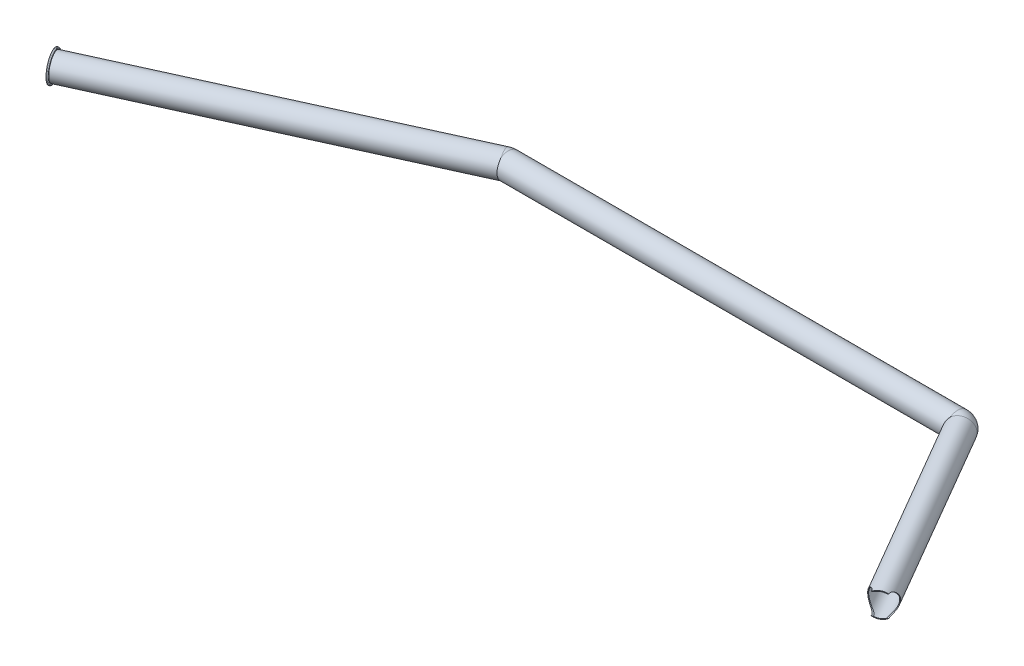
ISO-10303-21;
HEADER;
FILE_DESCRIPTION(('STEP AP214'),'2;1');
FILE_NAME('part.step','',(''),(''),'','','');
FILE_SCHEMA(('AUTOMOTIVE_DESIGN { 1 0 10303 214 1 1 1 1 }'));
ENDSEC;
DATA;
#1=APPLICATION_CONTEXT('core data for automotive mechanical design processes');
#2=APPLICATION_PROTOCOL_DEFINITION('international standard','automotive_design',2000,#1);
#3=PRODUCT_CONTEXT('',#1,'mechanical');
#4=PRODUCT('Part','Part','',(#3));
#5=PRODUCT_RELATED_PRODUCT_CATEGORY('part','',(#4));
#6=PRODUCT_DEFINITION_FORMATION('','',#4);
#7=PRODUCT_DEFINITION_CONTEXT('part definition',#1,'design');
#8=PRODUCT_DEFINITION('design','',#6,#7);
#9=PRODUCT_DEFINITION_SHAPE('','',#8);
#10=(LENGTH_UNIT() NAMED_UNIT(*) SI_UNIT(.MILLI.,.METRE.));
#11=(NAMED_UNIT(*) PLANE_ANGLE_UNIT() SI_UNIT($,.RADIAN.));
#12=(NAMED_UNIT(*) SI_UNIT($,.STERADIAN.) SOLID_ANGLE_UNIT());
#13=UNCERTAINTY_MEASURE_WITH_UNIT(LENGTH_MEASURE(1.E-05),#10,'distance_accuracy_value','');
#14=(GEOMETRIC_REPRESENTATION_CONTEXT(3) GLOBAL_UNCERTAINTY_ASSIGNED_CONTEXT((#13)) GLOBAL_UNIT_ASSIGNED_CONTEXT((#10,
#11,#12)) REPRESENTATION_CONTEXT('',''));
#15=CARTESIAN_POINT('',(0.,0.,0.));
#16=DIRECTION('',(0.,0.,1.));
#17=DIRECTION('',(1.,0.,0.));
#18=AXIS2_PLACEMENT_3D('',#15,#16,#17);
#19=CARTESIAN_POINT('',(0.,0.,0.));
#20=DIRECTION('',(0.910366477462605,0.,-0.413802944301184));
#21=DIRECTION('',(-0.413802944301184,0.,-0.910366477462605));
#22=AXIS2_PLACEMENT_3D('',#19,#20,#21);
#23=PLANE('',#22);
#24=CARTESIAN_POINT('',(0.,0.,0.));
#25=DIRECTION('',(0.910366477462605,0.,-0.413802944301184));
#26=DIRECTION('',(-0.413802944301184,0.,-0.910366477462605));
#27=AXIS2_PLACEMENT_3D('',#24,#25,#26);
#28=CIRCLE('',#27,20.);
#29=CARTESIAN_POINT('',(8.27605888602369,0.,18.2073295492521));
#30=VERTEX_POINT('',#29);
#31=EDGE_CURVE('E107',#30,#30,#28,.T.);
#32=ORIENTED_EDGE('',*,*,#31,.F.);
#33=EDGE_LOOP('',(#32));
#34=FACE_BOUND('',#33,.T.);
#35=CARTESIAN_POINT('',(0.,0.,0.));
#36=DIRECTION('',(0.910366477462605,0.,-0.413802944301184));
#37=DIRECTION('',(-0.413802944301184,0.,-0.910366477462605));
#38=AXIS2_PLACEMENT_3D('',#35,#36,#37);
#39=CIRCLE('',#38,4.);
#40=CARTESIAN_POINT('',(-1.65521177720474,0.,-3.64146590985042));
#41=VERTEX_POINT('',#40);
#42=EDGE_CURVE('E260',#41,#41,#39,.T.);
#43=ORIENTED_EDGE('',*,*,#42,.T.);
#44=EDGE_LOOP('',(#43));
#45=FACE_BOUND('',#44,.T.);
#46=ADVANCED_FACE('F33',(#34,#45),#23,.F.);
#47=CARTESIAN_POINT('',(1.82073295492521,0.,-0.827605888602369));
#48=DIRECTION('',(0.910366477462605,0.,-0.413802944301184));
#49=DIRECTION('',(-0.413802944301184,0.,-0.910366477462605));
#50=AXIS2_PLACEMENT_3D('',#47,#48,#49);
#51=PLANE('',#50);
#52=CARTESIAN_POINT('',(1.82073295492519,0.,-0.82760588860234));
#53=DIRECTION('',(0.910366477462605,0.,-0.413802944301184));
#54=DIRECTION('',(-0.413802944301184,0.,-0.910366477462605));
#55=AXIS2_PLACEMENT_3D('',#52,#53,#54);
#56=CIRCLE('',#55,16.5);
#57=CARTESIAN_POINT('',(8.64848153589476,0.,14.1934409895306));
#58=VERTEX_POINT('',#57);
#59=EDGE_CURVE('E109',#58,#58,#56,.T.);
#60=ORIENTED_EDGE('',*,*,#59,.T.);
#61=EDGE_LOOP('',(#60));
#62=FACE_BOUND('',#61,.T.);
#63=CARTESIAN_POINT('',(1.82073295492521,0.,-0.827605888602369));
#64=DIRECTION('',(0.910366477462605,0.,-0.413802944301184));
#65=DIRECTION('',(-0.413802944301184,0.,-0.910366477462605));
#66=AXIS2_PLACEMENT_3D('',#63,#64,#65);
#67=CIRCLE('',#66,4.);
#68=CARTESIAN_POINT('',(0.165521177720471,0.,-4.46907179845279));
#69=VERTEX_POINT('',#68);
#70=EDGE_CURVE('E37',#69,#69,#67,.F.);
#71=ORIENTED_EDGE('',*,*,#70,.T.);
#72=EDGE_LOOP('',(#71));
#73=FACE_BOUND('',#72,.T.);
#74=ADVANCED_FACE('F159',(#62,#73),#51,.T.);
#75=CARTESIAN_POINT('',(1084.62238321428,0.,-195.028935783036));
#76=DIRECTION('',(0.502893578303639,0.,0.864348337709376));
#77=DIRECTION('',(0.864348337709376,0.,-0.502893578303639));
#78=AXIS2_PLACEMENT_3D('',#75,#76,#77);
#79=CYLINDRICAL_SURFACE('',#78,17.5);
#80=CARTESIAN_POINT('',(1084.62238321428,0.,-195.028935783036));
#81=DIRECTION('',(0.502893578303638,0.,0.864348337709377));
#82=DIRECTION('',(0.864348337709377,0.,-0.502893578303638));
#83=AXIS2_PLACEMENT_3D('',#80,#81,#82);
#84=CIRCLE('',#83,17.5);
#85=CARTESIAN_POINT('',(1099.7484791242,0.,-203.82957340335));
#86=VERTEX_POINT('',#85);
#87=EDGE_CURVE('E95',#86,#86,#84,.T.);
#88=ORIENTED_EDGE('',*,*,#87,.T.);
#89=EDGE_LOOP('',(#88));
#90=FACE_BOUND('',#89,.T.);
#91=CARTESIAN_POINT('',(1241.73012766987,0.,74.9999999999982));
#92=DIRECTION('',(0.502893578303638,0.,0.864348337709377));
#93=DIRECTION('',(0.864348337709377,0.,-0.502893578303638));
#94=AXIS2_PLACEMENT_3D('',#91,#92,#93);
#95=CIRCLE('',#94,17.5);
#96=CARTESIAN_POINT('',(1233.79242673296,-14.8967855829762,79.6182987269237));
#97=VERTEX_POINT('',#96);
#98=CARTESIAN_POINT('',(1249.5214659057,-14.9998556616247,70.4668577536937));
#99=VERTEX_POINT('',#98);
#100=EDGE_CURVE('E97',#97,#99,#95,.T.);
#101=ORIENTED_EDGE('',*,*,#100,.F.);
#102=CARTESIAN_POINT('',(1233.792426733,-14.8967855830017,79.6182987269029));
#103=CARTESIAN_POINT('',(1233.71785323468,-14.9234913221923,79.4038572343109));
#104=CARTESIAN_POINT('',(1233.63520964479,-14.9450534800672,79.1915390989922));
#105=CARTESIAN_POINT('',(1233.45411301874,-14.9777878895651,78.7730678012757));
#106=CARTESIAN_POINT('',(1233.35566823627,-14.9889655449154,78.5669114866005));
#107=CARTESIAN_POINT('',(1233.14473198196,-15.0007716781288,78.1653302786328));
#108=CARTESIAN_POINT('',(1233.03246012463,-15.0015478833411,77.9697944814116));
#109=CARTESIAN_POINT('',(1232.79397734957,-14.9931551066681,77.5876577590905));
#110=CARTESIAN_POINT('',(1232.66776531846,-14.9839853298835,77.401057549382));
#111=CARTESIAN_POINT('',(1232.37252641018,-14.9528968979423,76.9957233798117));
#112=CARTESIAN_POINT('',(1232.20033220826,-14.9285291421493,76.779482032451));
#113=CARTESIAN_POINT('',(1231.84074080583,-14.8663718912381,76.3619528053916));
#114=CARTESIAN_POINT('',(1231.65333189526,-14.8285719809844,76.1606766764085));
#115=CARTESIAN_POINT('',(1231.26588309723,-14.7404172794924,75.7715431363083));
#116=CARTESIAN_POINT('',(1231.06578158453,-14.6899970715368,75.583762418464));
#117=CARTESIAN_POINT('',(1230.65700409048,-14.577715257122,75.2216359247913));
#118=CARTESIAN_POINT('',(1230.4483297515,-14.5158558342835,75.0472875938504));
#119=CARTESIAN_POINT('',(1229.87562581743,-14.3341239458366,74.5917472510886));
#120=CARTESIAN_POINT('',(1229.50578733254,-14.2040980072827,74.3218861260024));
#121=CARTESIAN_POINT('',(1228.75789299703,-13.9158244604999,73.8099794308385));
#122=CARTESIAN_POINT('',(1228.37983110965,-13.7575554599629,73.5679551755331));
#123=CARTESIAN_POINT('',(1227.62151280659,-13.4139508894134,73.1061390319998));
#124=CARTESIAN_POINT('',(1227.24125378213,-13.228570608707,72.8863849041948));
#125=CARTESIAN_POINT('',(1226.48421563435,-12.8315584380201,72.4657952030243));
#126=CARTESIAN_POINT('',(1226.10743561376,-12.6199335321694,72.2649546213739));
#127=CARTESIAN_POINT('',(1225.32904497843,-12.1509340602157,71.8628411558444));
#128=CARTESIAN_POINT('',(1224.9281046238,-11.8911858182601,71.6630327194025));
#129=CARTESIAN_POINT('',(1224.13979705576,-11.3401388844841,71.2805390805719));
#130=CARTESIAN_POINT('',(1223.75243243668,-11.0488342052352,71.0978571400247));
#131=CARTESIAN_POINT('',(1222.99702372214,-10.4346369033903,70.7490663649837));
#132=CARTESIAN_POINT('',(1222.62894371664,-10.1118064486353,70.5829261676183));
#133=CARTESIAN_POINT('',(1221.91674227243,-9.4335080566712,70.2668004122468));
#134=CARTESIAN_POINT('',(1221.57261235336,-9.07805177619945,70.1168091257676));
#135=CARTESIAN_POINT('',(1220.99867868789,-8.42952780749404,69.8699436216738));
#136=CARTESIAN_POINT('',(1220.76217246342,-8.14380724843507,69.7693059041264));
#137=CARTESIAN_POINT('',(1220.30853337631,-7.55428451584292,69.5778746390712));
#138=CARTESIAN_POINT('',(1220.09139608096,-7.25048650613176,69.4870788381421));
#139=CARTESIAN_POINT('',(1219.67963662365,-6.62546090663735,69.3160766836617));
#140=CARTESIAN_POINT('',(1219.48499750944,-6.30424671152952,69.2358623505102));
#141=CARTESIAN_POINT('',(1219.12127592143,-5.64511614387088,69.0867904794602));
#142=CARTESIAN_POINT('',(1218.95218943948,-5.30720240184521,69.0179311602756));
#143=CARTESIAN_POINT('',(1218.66725834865,-4.67074615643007,68.9023926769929));
#144=CARTESIAN_POINT('',(1218.54722256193,-4.37440182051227,68.8539281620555));
#145=CARTESIAN_POINT('',(1218.32950791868,-3.77229934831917,68.7662771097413));
#146=CARTESIAN_POINT('',(1218.23182463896,-3.4665430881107,68.7270887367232));
#147=CARTESIAN_POINT('',(1218.06055911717,-2.84740072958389,68.6585236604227));
#148=CARTESIAN_POINT('',(1217.9869660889,-2.53401811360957,68.6291425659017));
#149=CARTESIAN_POINT('',(1217.8652429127,-1.90154023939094,68.5806105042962));
#150=CARTESIAN_POINT('',(1217.81711299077,-1.58244493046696,68.5614596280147));
#151=CARTESIAN_POINT('',(1217.74718527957,-0.939727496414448,68.5336517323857));
#152=CARTESIAN_POINT('',(1217.72548469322,-0.616093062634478,68.5250334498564));
#153=CARTESIAN_POINT('',(1217.70920861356,0.0319684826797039,68.5185685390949));
#154=CARTESIAN_POINT('',(1217.71463316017,0.35639559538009,68.5207219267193));
#155=CARTESIAN_POINT('',(1217.75249001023,1.00344187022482,68.5357631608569));
#156=CARTESIAN_POINT('',(1217.78492487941,1.3260608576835,68.5486520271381));
#157=CARTESIAN_POINT('',(1217.87611280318,1.96694014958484,68.5849460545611));
#158=CARTESIAN_POINT('',(1217.93486551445,2.28520051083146,68.6083510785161));
#159=CARTESIAN_POINT('',(1218.0735669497,2.89776757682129,68.6637343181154));
#160=CARTESIAN_POINT('',(1218.15217356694,3.19242955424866,68.695170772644));
#161=CARTESIAN_POINT('',(1218.33048565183,3.77417975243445,68.7666858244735));
#162=CARTESIAN_POINT('',(1218.43018970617,4.061268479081,68.8067638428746));
#163=CARTESIAN_POINT('',(1218.64918489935,4.62659700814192,68.8951062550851));
#164=CARTESIAN_POINT('',(1218.76847859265,4.90483565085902,68.9433717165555));
#165=CARTESIAN_POINT('',(1219.02501442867,5.45144110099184,69.0476090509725));
#166=CARTESIAN_POINT('',(1219.16226032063,5.71980583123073,69.1035825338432));
#167=CARTESIAN_POINT('',(1219.51245542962,6.35340019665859,69.2471239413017));
#168=CARTESIAN_POINT('',(1219.73342585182,6.71341291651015,69.3382573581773));
#169=CARTESIAN_POINT('',(1220.20313156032,7.41105758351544,69.5337074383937));
#170=CARTESIAN_POINT('',(1220.45187625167,7.74868188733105,69.6380285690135));
#171=CARTESIAN_POINT('',(1220.97340564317,8.4016315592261,69.8591235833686));
#172=CARTESIAN_POINT('',(1221.24623949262,8.71690885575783,69.9759230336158));
#173=CARTESIAN_POINT('',(1221.81161452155,9.32430675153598,70.2211271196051));
#174=CARTESIAN_POINT('',(1222.10415560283,9.61642746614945,70.3495316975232));
#175=CARTESIAN_POINT('',(1222.80494629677,10.2706108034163,70.6619555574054));
#176=CARTESIAN_POINT('',(1223.21948234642,10.6238793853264,70.8503294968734));
#177=CARTESIAN_POINT('',(1224.07021388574,11.290924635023,71.2473768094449));
#178=CARTESIAN_POINT('',(1224.50641953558,11.6046825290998,71.4560597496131));
#179=CARTESIAN_POINT('',(1225.3937895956,12.1935340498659,71.8954314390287));
#180=CARTESIAN_POINT('',(1225.844959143,12.468614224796,72.126127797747));
#181=CARTESIAN_POINT('',(1226.75515572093,12.9802991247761,72.6128304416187));
#182=CARTESIAN_POINT('',(1227.21417859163,13.2169235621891,72.8688236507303));
#183=CARTESIAN_POINT('',(1227.95153868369,13.5657908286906,73.3052104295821));
#184=CARTESIAN_POINT('',(1228.22993888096,13.6903518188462,73.4757412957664));
#185=CARTESIAN_POINT('',(1228.78444676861,13.9247450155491,73.8302374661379));
#186=CARTESIAN_POINT('',(1229.06055443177,14.0345770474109,74.0142029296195));
#187=CARTESIAN_POINT('',(1229.60706924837,14.2386059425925,74.3975138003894));
#188=CARTESIAN_POINT('',(1229.87748646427,14.3328328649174,74.5968285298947));
#189=CARTESIAN_POINT('',(1230.4092123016,14.5047623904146,75.0136549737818));
#190=CARTESIAN_POINT('',(1230.67052423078,14.5824710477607,75.2311599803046));
#191=CARTESIAN_POINT('',(1231.2871006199,14.7489482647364,75.7841476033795));
#192=CARTESIAN_POINT('',(1231.63540795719,14.828515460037,76.1306465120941));
#193=CARTESIAN_POINT('',(1232.12192584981,14.9158515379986,76.6858109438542));
#194=CARTESIAN_POINT('',(1232.27795213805,14.9396189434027,76.8765334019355));
#195=CARTESIAN_POINT('',(1232.57575495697,14.9758236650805,77.2698461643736));
#196=CARTESIAN_POINT('',(1232.71753630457,14.9882648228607,77.4724324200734));
#197=CARTESIAN_POINT('',(1232.94804868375,14.9994526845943,77.8316461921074));
#198=CARTESIAN_POINT('',(1233.04068662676,15.0010132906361,77.985698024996));
#199=CARTESIAN_POINT('',(1233.21660840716,14.9977114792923,78.2989878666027));
#200=CARTESIAN_POINT('',(1233.29989303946,14.9928496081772,78.4582254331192));
#201=CARTESIAN_POINT('',(1233.45723940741,14.9765999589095,78.7822360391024));
#202=CARTESIAN_POINT('',(1233.53123280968,14.9651669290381,78.9470399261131));
#203=CARTESIAN_POINT('',(1233.66929004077,14.9358187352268,79.2802232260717));
#204=CARTESIAN_POINT('',(1233.733352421,14.9179026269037,79.4486031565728));
#205=CARTESIAN_POINT('',(1233.79242673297,14.8967855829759,79.6182987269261));
#206=B_SPLINE_CURVE_WITH_KNOTS('',3,(#102,#103,#104,#105,#106,#107,#108,#109,#110,#111,#112,
#113,#114,#115,#116,#117,#118,#119,#120,#121,#122,#123,#124,#125,#126,#127,#128,#129,#130,#131,
#132,#133,#134,#135,#136,#137,#138,#139,#140,#141,#142,#143,#144,#145,#146,#147,#148,#149,#150,
#151,#152,#153,#154,#155,#156,#157,#158,#159,#160,#161,#162,#163,#164,#165,#166,#167,#168,#169,
#170,#171,#172,#173,#174,#175,#176,#177,#178,#179,#180,#181,#182,#183,#184,#185,#186,#187,#188,
#189,#190,#191,#192,#193,#194,#195,#196,#197,#198,#199,#200,#201,#202,#203,#204,#205),
.UNSPECIFIED.,.F.,.F.,(4,2,2,2,2,2,2,2,2,2,2,2,2,2,2,2,2,2,2,2,2,2,2,2,2,2,2,2,2,2,2,2,2,2,2,2,
2,2,2,2,2,2,2,2,2,2,2,2,2,2,2,4),(0.,0.685665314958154,1.37097363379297,2.04653832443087,
2.72215701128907,3.55332166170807,4.38513219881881,5.22134706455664,6.05740247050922,
7.48287815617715,8.90943816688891,10.3383778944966,11.7669381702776,13.319031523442,
14.8714198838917,16.4208065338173,17.9696417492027,19.1216719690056,20.2734378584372,
21.4243301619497,22.5750417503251,23.5442290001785,24.5132242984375,25.4817851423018,
26.4503545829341,27.4224756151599,28.3945980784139,29.3668128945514,30.3390150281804,
31.2577952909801,32.1765140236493,33.095352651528,34.0143834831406,35.3088654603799,
36.6037871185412,37.9014147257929,39.1990358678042,40.9255357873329,42.6528529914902,
44.3807694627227,46.1077973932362,47.155615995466,48.2034470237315,49.2492356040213,
50.2946402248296,51.781779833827,52.5236777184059,53.265323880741,53.8042271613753,
54.3430846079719,54.8856980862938,55.4283906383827),.UNSPECIFIED.);
#207=CARTESIAN_POINT('',(1233.792426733,14.8967855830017,79.6182987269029));
#208=VERTEX_POINT('',#207);
#209=EDGE_CURVE('E49',#97,#208,#206,.T.);
#210=ORIENTED_EDGE('',*,*,#209,.T.);
#211=CARTESIAN_POINT('',(1249.52146590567,14.9998556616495,70.4668577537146));
#212=VERTEX_POINT('',#211);
#213=EDGE_CURVE('E82',#212,#208,#95,.T.);
#214=ORIENTED_EDGE('',*,*,#213,.F.);
#215=CARTESIAN_POINT('',(1249.52146590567,14.9998556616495,70.4668577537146));
#216=CARTESIAN_POINT('',(1249.46103597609,14.9993260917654,70.3612503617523));
#217=CARTESIAN_POINT('',(1249.40275325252,14.997323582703,70.2544412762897));
#218=CARTESIAN_POINT('',(1249.29058284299,14.9903621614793,70.0386448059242));
#219=CARTESIAN_POINT('',(1249.23669480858,14.9854034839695,69.9296575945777));
#220=CARTESIAN_POINT('',(1249.081952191,14.9661009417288,69.6001506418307));
#221=CARTESIAN_POINT('',(1248.98779327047,14.9473286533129,69.3766905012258));
#222=CARTESIAN_POINT('',(1248.81869349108,14.8985702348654,68.9277793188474));
#223=CARTESIAN_POINT('',(1248.74348334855,14.8687581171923,68.7024095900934));
#224=CARTESIAN_POINT('',(1248.60949184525,14.7983451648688,68.2484327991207));
#225=CARTESIAN_POINT('',(1248.55071778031,14.7577395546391,68.0198243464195));
#226=CARTESIAN_POINT('',(1248.42981211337,14.6499464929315,67.4792620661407));
#227=CARTESIAN_POINT('',(1248.37400343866,14.5784464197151,67.1667538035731));
#228=CARTESIAN_POINT('',(1248.2855735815,14.4180571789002,66.5429615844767));
#229=CARTESIAN_POINT('',(1248.25296201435,14.32916081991,66.2316781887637));
#230=CARTESIAN_POINT('',(1248.20632382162,14.1345103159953,65.6105518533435));
#231=CARTESIAN_POINT('',(1248.1924363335,14.0286364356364,65.3007365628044));
#232=CARTESIAN_POINT('',(1248.17972571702,13.8014731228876,64.6865862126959));
#233=CARTESIAN_POINT('',(1248.1809025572,13.680183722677,64.3822511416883));
#234=CARTESIAN_POINT('',(1248.19876425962,13.3532781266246,63.6174194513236));
#235=CARTESIAN_POINT('',(1248.22348700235,13.1375154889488,63.1614211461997));
#236=CARTESIAN_POINT('',(1248.29135853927,12.6723902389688,62.2682332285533));
#237=CARTESIAN_POINT('',(1248.33451596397,12.4230119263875,61.8310525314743));
#238=CARTESIAN_POINT('',(1248.43249949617,11.891493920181,60.97869322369));
#239=CARTESIAN_POINT('',(1248.48732086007,11.6093675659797,60.5635057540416));
#240=CARTESIAN_POINT('',(1248.60352414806,11.0126845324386,59.7581919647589));
#241=CARTESIAN_POINT('',(1248.66490488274,10.6981337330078,59.3680611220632));
#242=CARTESIAN_POINT('',(1248.79113349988,10.031862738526,58.6107466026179));
#243=CARTESIAN_POINT('',(1248.8560197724,9.6796524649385,58.2439990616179));
#244=CARTESIAN_POINT('',(1248.98484370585,8.94261455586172,57.5444422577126));
#245=CARTESIAN_POINT('',(1249.04878122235,8.55778201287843,57.2116381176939));
#246=CARTESIAN_POINT('',(1249.17242707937,7.75768651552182,56.5859126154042));
#247=CARTESIAN_POINT('',(1249.23214495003,7.34249674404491,56.2928999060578));
#248=CARTESIAN_POINT('',(1249.34468154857,6.48312227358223,55.7515748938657));
#249=CARTESIAN_POINT('',(1249.39750387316,6.03895287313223,55.5032392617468));
#250=CARTESIAN_POINT('',(1249.47889653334,5.26597663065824,55.1258071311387));
#251=CARTESIAN_POINT('',(1249.50992402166,4.94380286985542,54.9835492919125));
#252=CARTESIAN_POINT('',(1249.56673637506,4.28877798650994,54.7250038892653));
#253=CARTESIAN_POINT('',(1249.59252252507,3.95592950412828,54.6087099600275));
#254=CARTESIAN_POINT('',(1249.63819754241,3.28159142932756,54.40381178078));
#255=CARTESIAN_POINT('',(1249.65808945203,2.9401063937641,54.3151932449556));
#256=CARTESIAN_POINT('',(1249.69147760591,2.25055533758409,54.1669565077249));
#257=CARTESIAN_POINT('',(1249.70497361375,1.9024890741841,54.1073393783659));
#258=CARTESIAN_POINT('',(1249.72523755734,1.2011922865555,54.0179726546));
#259=CARTESIAN_POINT('',(1249.7319836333,0.847948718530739,53.9883200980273));
#260=CARTESIAN_POINT('',(1249.73848447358,0.140153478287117,53.959743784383));
#261=CARTESIAN_POINT('',(1249.73823926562,-0.214398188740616,53.9608199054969));
#262=CARTESIAN_POINT('',(1249.73076433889,-0.922018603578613,53.9936819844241));
#263=CARTESIAN_POINT('',(1249.72353416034,-1.27508725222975,54.0254699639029));
#264=CARTESIAN_POINT('',(1249.70228832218,-1.97697552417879,54.119200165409));
#265=CARTESIAN_POINT('',(1249.68827279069,-2.32579522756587,54.1811418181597));
#266=CARTESIAN_POINT('',(1249.65465076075,-3.00031598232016,54.3305118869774));
#267=CARTESIAN_POINT('',(1249.6353396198,-3.32633077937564,54.416598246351));
#268=CARTESIAN_POINT('',(1249.59136377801,-3.97024625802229,54.6139455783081));
#269=CARTESIAN_POINT('',(1249.56669928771,-4.28814725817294,54.7252055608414));
#270=CARTESIAN_POINT('',(1249.51257815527,-4.91421083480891,54.9714393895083));
#271=CARTESIAN_POINT('',(1249.48312112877,-5.22237262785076,55.106415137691));
#272=CARTESIAN_POINT('',(1249.42006095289,-5.82761150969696,55.3984735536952));
#273=CARTESIAN_POINT('',(1249.38645726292,-6.1246871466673,55.5555591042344));
#274=CARTESIAN_POINT('',(1249.3126950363,-6.7323879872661,55.9049493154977));
#275=CARTESIAN_POINT('',(1249.27221965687,-7.04188994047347,56.099139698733));
#276=CARTESIAN_POINT('',(1249.1881959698,-7.6454430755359,56.5095710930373));
#277=CARTESIAN_POINT('',(1249.14464750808,-7.93949348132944,56.7258132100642));
#278=CARTESIAN_POINT('',(1249.0555261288,-8.51153253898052,57.1783703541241));
#279=CARTESIAN_POINT('',(1249.00995250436,-8.78951550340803,57.4146924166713));
#280=CARTESIAN_POINT('',(1248.91793733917,-9.32886330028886,57.9054449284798));
#281=CARTESIAN_POINT('',(1248.8714957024,-9.5902262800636,58.159877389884));
#282=CARTESIAN_POINT('',(1248.77015225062,-10.1443527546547,58.7352754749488));
#283=CARTESIAN_POINT('',(1248.71532885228,-10.4335784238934,59.05966673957));
#284=CARTESIAN_POINT('',(1248.60858717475,-10.987758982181,59.7290486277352));
#285=CARTESIAN_POINT('',(1248.5566694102,-11.2527095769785,60.0740428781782));
#286=CARTESIAN_POINT('',(1248.45851348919,-11.7583675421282,60.7826707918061));
#287=CARTESIAN_POINT('',(1248.4122813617,-11.9990491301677,61.1463236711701));
#288=CARTESIAN_POINT('',(1248.32904564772,-12.4555667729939,61.8898562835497));
#289=CARTESIAN_POINT('',(1248.29204040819,-12.6714072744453,62.2697330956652));
#290=CARTESIAN_POINT('',(1248.23698448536,-13.0424360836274,62.9764726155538));
#291=CARTESIAN_POINT('',(1248.21675620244,-13.2016433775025,63.3010602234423));
#292=CARTESIAN_POINT('',(1248.18889515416,-13.50236320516,63.9589636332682));
#293=CARTESIAN_POINT('',(1248.18126383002,-13.6438737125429,64.2922804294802));
#294=CARTESIAN_POINT('',(1248.18267353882,-13.9082049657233,64.9656651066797));
#295=CARTESIAN_POINT('',(1248.19168835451,-14.0310547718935,65.3057215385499));
#296=CARTESIAN_POINT('',(1248.23138888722,-14.2571492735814,65.9910415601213));
#297=CARTESIAN_POINT('',(1248.26206361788,-14.3604038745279,66.3363024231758));
#298=CARTESIAN_POINT('',(1248.33678610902,-14.516105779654,66.9182308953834));
#299=CARTESIAN_POINT('',(1248.37342462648,-14.5742433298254,67.1543318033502));
#300=CARTESIAN_POINT('',(1248.46143898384,-14.6800996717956,67.6260946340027));
#301=CARTESIAN_POINT('',(1248.51280948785,-14.7278222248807,67.861756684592));
#302=CARTESIAN_POINT('',(1248.63192502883,-14.8121021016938,68.3302059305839));
#303=CARTESIAN_POINT('',(1248.69962094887,-14.8486921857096,68.5629995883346));
#304=CARTESIAN_POINT('',(1248.85278103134,-14.9103069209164,69.024151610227));
#305=CARTESIAN_POINT('',(1248.93823490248,-14.9353382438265,69.2525124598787));
#306=CARTESIAN_POINT('',(1249.10399330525,-14.96874112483,69.6466848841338));
#307=CARTESIAN_POINT('',(1249.18031782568,-14.979704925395,69.8139618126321));
#308=CARTESIAN_POINT('',(1249.34324278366,-14.9948733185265,70.1440518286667));
#309=CARTESIAN_POINT('',(1249.42985805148,-14.9990680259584,70.3068580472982));
#310=CARTESIAN_POINT('',(1249.52146590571,-14.9998556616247,70.4668577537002));
#311=B_SPLINE_CURVE_WITH_KNOTS('',3,(#215,#216,#217,#218,#219,#220,#221,#222,#223,#224,#225,
#226,#227,#228,#229,#230,#231,#232,#233,#234,#235,#236,#237,#238,#239,#240,#241,#242,#243,#244,
#245,#246,#247,#248,#249,#250,#251,#252,#253,#254,#255,#256,#257,#258,#259,#260,#261,#262,#263,
#264,#265,#266,#267,#268,#269,#270,#271,#272,#273,#274,#275,#276,#277,#278,#279,#280,#281,#282,
#283,#284,#285,#286,#287,#288,#289,#290,#291,#292,#293,#294,#295,#296,#297,#298,#299,#300,#301,
#302,#303,#304,#305,#306,#307,#308,#309,#310),.UNSPECIFIED.,.F.,.F.,(4,2,2,2,2,2,2,2,2,2,2,2,2,
2,2,2,2,2,2,2,2,2,2,2,2,2,2,2,2,2,2,2,2,2,2,2,2,2,2,2,2,2,2,2,2,2,2,4),(0.,0.364959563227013,
0.729890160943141,1.45839165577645,2.17586785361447,2.89366202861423,3.86828201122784,
4.84330574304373,5.82553560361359,6.8077634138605,8.32085754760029,9.83466083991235,
11.3478496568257,12.860764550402,14.3965540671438,15.93257503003,17.4650079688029,
18.9966383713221,20.0562454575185,21.1155924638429,22.1743917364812,23.233230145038,
24.2954866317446,25.3577389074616,26.4200611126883,27.4823632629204,28.4944879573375,
29.5065728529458,30.5187389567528,31.5310371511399,32.6328099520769,33.7346380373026,
34.8368537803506,35.9391921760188,37.2520859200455,38.5652114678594,39.8797176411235,
41.1939881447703,42.2796020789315,43.3653402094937,44.4493697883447,45.5328499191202,
46.2699848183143,47.0068530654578,47.7415314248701,48.4757851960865,49.027918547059,
49.5808574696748),.UNSPECIFIED.);
#312=EDGE_CURVE('E148',#212,#99,#311,.T.);
#313=ORIENTED_EDGE('',*,*,#312,.T.);
#314=EDGE_LOOP('',(#101,#210,#214,#313));
#315=FACE_BOUND('',#314,.T.);
#316=ADVANCED_FACE('F156',(#90,#315),#79,.T.);
#317=CARTESIAN_POINT('',(1084.62238321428,0.,-195.028935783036));
#318=DIRECTION('',(0.502893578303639,0.,0.864348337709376));
#319=DIRECTION('',(0.864348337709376,0.,-0.502893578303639));
#320=AXIS2_PLACEMENT_3D('',#317,#318,#319);
#321=CYLINDRICAL_SURFACE('',#320,16.5);
#322=CARTESIAN_POINT('',(1084.62238321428,0.,-195.028935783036));
#323=DIRECTION('',(0.502893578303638,0.,0.864348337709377));
#324=DIRECTION('',(0.864348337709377,0.,-0.502893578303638));
#325=AXIS2_PLACEMENT_3D('',#322,#323,#324);
#326=CIRCLE('',#325,16.5);
#327=CARTESIAN_POINT('',(1098.88413078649,0.,-203.326679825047));
#328=VERTEX_POINT('',#327);
#329=EDGE_CURVE('E99',#328,#328,#326,.T.);
#330=ORIENTED_EDGE('',*,*,#329,.F.);
#331=EDGE_LOOP('',(#330));
#332=FACE_BOUND('',#331,.T.);
#333=CARTESIAN_POINT('',(1235.64096842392,-14.9204833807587,78.5427835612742));
#334=CARTESIAN_POINT('',(1235.58418582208,-14.9397976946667,78.3637372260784));
#335=CARTESIAN_POINT('',(1235.52033553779,-14.9556415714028,78.1865013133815));
#336=CARTESIAN_POINT('',(1235.37857882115,-14.9802729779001,77.8373314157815));
#337=CARTESIAN_POINT('',(1235.30067824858,-14.9890634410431,77.665395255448));
#338=CARTESIAN_POINT('',(1235.13222184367,-14.9994047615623,77.3310712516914));
#339=CARTESIAN_POINT('',(1235.04189029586,-15.0010700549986,77.1685741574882));
#340=CARTESIAN_POINT('',(1234.84859926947,-14.9976073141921,76.8513786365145));
#341=CARTESIAN_POINT('',(1234.74563961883,-14.9924791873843,76.6966803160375));
#342=CARTESIAN_POINT('',(1234.50416070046,-14.9738338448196,76.3620566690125));
#343=CARTESIAN_POINT('',(1234.36284181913,-14.958694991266,76.1842411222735));
#344=CARTESIAN_POINT('',(1234.06642665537,-14.9193888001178,75.8414470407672));
#345=CARTESIAN_POINT('',(1233.91131925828,-14.8952141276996,75.6764790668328));
#346=CARTESIAN_POINT('',(1233.58960268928,-14.8384712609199,75.3579008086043));
#347=CARTESIAN_POINT('',(1233.42293340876,-14.8058563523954,75.2043600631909));
#348=CARTESIAN_POINT('',(1233.08162940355,-14.7330280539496,74.908509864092));
#349=CARTESIAN_POINT('',(1232.90699605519,-14.6928159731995,74.7661984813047));
#350=CARTESIAN_POINT('',(1232.39543499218,-14.5668390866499,74.3702011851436));
#351=CARTESIAN_POINT('',(1232.05111482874,-14.4721612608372,74.1288942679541));
#352=CARTESIAN_POINT('',(1231.35209022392,-14.2605418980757,73.6724362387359));
#353=CARTESIAN_POINT('',(1230.99737608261,-14.1435789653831,73.4573105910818));
#354=CARTESIAN_POINT('',(1230.28298349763,-13.8883365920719,73.0465607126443));
#355=CARTESIAN_POINT('',(1229.92329393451,-13.7499983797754,72.8509927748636));
#356=CARTESIAN_POINT('',(1229.20430042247,-13.4528000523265,72.4757605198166));
#357=CARTESIAN_POINT('',(1228.84499639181,-13.2939459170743,72.2960915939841));
#358=CARTESIAN_POINT('',(1228.23373671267,-13.0048548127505,72.0000329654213));
#359=CARTESIAN_POINT('',(1227.98091593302,-12.8797089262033,71.8804220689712));
#360=CARTESIAN_POINT('',(1227.47796741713,-12.6189975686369,71.6470262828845));
#361=CARTESIAN_POINT('',(1227.22783981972,-12.4834315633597,71.533241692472));
#362=CARTESIAN_POINT('',(1226.48266385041,-12.0607936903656,71.1997204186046));
#363=CARTESIAN_POINT('',(1225.99294733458,-11.7578405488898,70.9878757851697));
#364=CARTESIAN_POINT('',(1225.03638574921,-11.1090596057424,70.5835911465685));
#365=CARTESIAN_POINT('',(1224.56948294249,-10.7633487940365,70.3911006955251));
#366=CARTESIAN_POINT('',(1223.66521568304,-10.0270673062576,70.0246656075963));
#367=CARTESIAN_POINT('',(1223.22783174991,-9.63652668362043,69.8507086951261));
#368=CARTESIAN_POINT('',(1222.27344946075,-8.69224601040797,69.4759451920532));
#369=CARTESIAN_POINT('',(1221.7685083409,-8.12344813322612,69.2812838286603));
#370=CARTESIAN_POINT('',(1221.07616714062,-7.21360429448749,69.0172314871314));
#371=CARTESIAN_POINT('',(1220.85626800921,-6.90094769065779,68.9338840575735));
#372=CARTESIAN_POINT('',(1220.44129765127,-6.2570501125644,68.7773239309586));
#373=CARTESIAN_POINT('',(1220.2462223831,-5.9258121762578,68.7041095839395));
#374=CARTESIAN_POINT('',(1219.91528173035,-5.303748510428,68.5803530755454));
#375=CARTESIAN_POINT('',(1219.7749877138,-5.0156191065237,68.5280723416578));
#376=CARTESIAN_POINT('',(1219.51610114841,-4.4284471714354,68.4318338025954));
#377=CARTESIAN_POINT('',(1219.39750389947,-4.12940702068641,68.3878741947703));
#378=CARTESIAN_POINT('',(1219.18404092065,-3.52193507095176,68.3088990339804));
#379=CARTESIAN_POINT('',(1219.08916529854,-3.2135072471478,68.2738797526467));
#380=CARTESIAN_POINT('',(1218.92487787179,-2.58899790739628,68.2133199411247));
#381=CARTESIAN_POINT('',(1218.85546623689,-2.27291634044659,68.1877794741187));
#382=CARTESIAN_POINT('',(1218.74324595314,-1.63362962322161,68.1465197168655));
#383=CARTESIAN_POINT('',(1218.70058398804,-1.31039508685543,68.1308545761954));
#384=CARTESIAN_POINT('',(1218.64341600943,-0.661098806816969,68.1098684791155));
#385=CARTESIAN_POINT('',(1218.62891003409,-0.335037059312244,68.1045475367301));
#386=CARTESIAN_POINT('',(1218.62838857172,0.317072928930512,68.1043562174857));
#387=CARTESIAN_POINT('',(1218.6423698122,0.643121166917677,68.1094846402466));
#388=CARTESIAN_POINT('',(1218.69849503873,1.29243642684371,68.1300875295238));
#389=CARTESIAN_POINT('',(1218.74063785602,1.61570356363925,68.1455615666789));
#390=CARTESIAN_POINT('',(1218.84734743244,2.22931249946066,68.1847938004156));
#391=CARTESIAN_POINT('',(1218.90968062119,2.52010000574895,68.2077275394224));
#392=CARTESIAN_POINT('',(1219.05598011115,3.09537489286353,68.261640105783));
#393=CARTESIAN_POINT('',(1219.13994442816,3.37986284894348,68.2926181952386));
#394=CARTESIAN_POINT('',(1219.32816760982,3.94112853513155,68.3622037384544));
#395=CARTESIAN_POINT('',(1219.43243069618,4.21790464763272,68.4008127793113));
#396=CARTESIAN_POINT('',(1219.6597190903,4.76253741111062,68.485190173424));
#397=CARTESIAN_POINT('',(1219.7827482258,5.03039222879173,68.5309599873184));
#398=CARTESIAN_POINT('',(1220.0933801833,5.65098122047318,68.6468695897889));
#399=CARTESIAN_POINT('',(1220.28828288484,5.9995486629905,68.7198500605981));
#400=CARTESIAN_POINT('',(1220.70580109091,6.67700270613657,68.8769973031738));
#401=CARTESIAN_POINT('',(1220.92842488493,7.00588337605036,68.9611674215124));
#402=CARTESIAN_POINT('',(1221.39787822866,7.64365272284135,69.1397772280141));
#403=CARTESIAN_POINT('',(1221.64474346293,7.95251078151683,69.2342320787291));
#404=CARTESIAN_POINT('',(1222.15887052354,8.54946747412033,69.4324437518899));
#405=CARTESIAN_POINT('',(1222.42613286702,8.83756558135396,69.5362008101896));
#406=CARTESIAN_POINT('',(1223.0842924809,9.50025657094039,69.7940446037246));
#407=CARTESIAN_POINT('',(1223.48315304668,9.86541170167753,69.9521212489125));
#408=CARTESIAN_POINT('',(1224.30689641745,10.5572971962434,70.2839855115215));
#409=CARTESIAN_POINT('',(1224.73179102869,10.8840099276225,70.4577802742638));
#410=CARTESIAN_POINT('',(1225.60220878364,11.5008503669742,70.8214823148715));
#411=CARTESIAN_POINT('',(1226.04777352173,11.790899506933,71.0114227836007));
#412=CARTESIAN_POINT('',(1226.95294760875,12.3347852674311,71.4083095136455));
#413=CARTESIAN_POINT('',(1227.41255257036,12.5886330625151,71.615250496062));
#414=CARTESIAN_POINT('',(1228.25875635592,13.0195896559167,72.011008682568));
#415=CARTESIAN_POINT('',(1228.6439937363,13.2023450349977,72.1966216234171));
#416=CARTESIAN_POINT('',(1229.41689027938,13.5441859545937,72.5844366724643));
#417=CARTESIAN_POINT('',(1229.80455026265,13.7032629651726,72.7866447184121));
#418=CARTESIAN_POINT('',(1230.5763873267,13.9968911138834,73.2114513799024));
#419=CARTESIAN_POINT('',(1230.96057131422,14.1315133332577,73.4339879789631));
#420=CARTESIAN_POINT('',(1231.71979452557,14.3755668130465,73.9066151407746));
#421=CARTESIAN_POINT('',(1232.09484294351,14.4850244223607,74.1566764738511));
#422=CARTESIAN_POINT('',(1232.6297826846,14.6250792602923,74.5504244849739));
#423=CARTESIAN_POINT('',(1232.79756409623,14.6665638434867,74.679559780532));
#424=CARTESIAN_POINT('',(1233.12717947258,14.7430833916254,74.9471325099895));
#425=CARTESIAN_POINT('',(1233.28901257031,14.7781174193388,75.0855712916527));
#426=CARTESIAN_POINT('',(1233.60439522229,14.8411308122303,75.3725605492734));
#427=CARTESIAN_POINT('',(1233.75795971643,14.8691232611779,75.521091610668));
#428=CARTESIAN_POINT('',(1234.05463554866,14.9174889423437,75.829325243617));
#429=CARTESIAN_POINT('',(1234.1977534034,14.9378669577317,75.9890207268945));
#430=CARTESIAN_POINT('',(1234.45068572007,14.9679459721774,76.2954800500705));
#431=CARTESIAN_POINT('',(1234.56229177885,14.9787820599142,76.4406505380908));
#432=CARTESIAN_POINT('',(1234.77438784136,14.9940814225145,76.739149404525));
#433=CARTESIAN_POINT('',(1234.87488322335,14.9985477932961,76.8924737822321));
#434=CARTESIAN_POINT('',(1235.06340429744,15.0008506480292,77.2065034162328));
#435=CARTESIAN_POINT('',(1235.15143936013,14.99869214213,77.3672030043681));
#436=CARTESIAN_POINT('',(1235.31428802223,14.9876528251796,77.6948763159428));
#437=CARTESIAN_POINT('',(1235.38910756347,14.9787750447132,77.8618471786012));
#438=CARTESIAN_POINT('',(1235.49114878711,14.9605165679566,78.1154529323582));
#439=CARTESIAN_POINT('',(1235.52339411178,14.9536309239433,78.2002895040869));
#440=CARTESIAN_POINT('',(1235.58460724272,14.9382542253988,78.3708710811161));
#441=CARTESIAN_POINT('',(1235.61357917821,14.9297652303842,78.456614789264));
#442=CARTESIAN_POINT('',(1235.64096842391,14.9204833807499,78.5427835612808));
#443=B_SPLINE_CURVE_WITH_KNOTS('',3,(#333,#334,#335,#336,#337,#338,#339,#340,#341,#342,#343,
#344,#345,#346,#347,#348,#349,#350,#351,#352,#353,#354,#355,#356,#357,#358,#359,#360,#361,#362,
#363,#364,#365,#366,#367,#368,#369,#370,#371,#372,#373,#374,#375,#376,#377,#378,#379,#380,#381,
#382,#383,#384,#385,#386,#387,#388,#389,#390,#391,#392,#393,#394,#395,#396,#397,#398,#399,#400,
#401,#402,#403,#404,#405,#406,#407,#408,#409,#410,#411,#412,#413,#414,#415,#416,#417,#418,#419,
#420,#421,#422,#423,#424,#425,#426,#427,#428,#429,#430,#431,#432,#433,#434,#435,#436,#437,#438,
#439,#440,#441,#442),.UNSPECIFIED.,.F.,.F.,(4,2,2,2,2,2,2,2,2,2,2,2,2,2,2,2,2,2,2,2,2,2,2,2,2,2,
2,2,2,2,2,2,2,2,2,2,2,2,2,2,2,2,2,2,2,2,2,2,2,2,2,2,2,2,4),(0.,0.566387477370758,
1.13253928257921,1.68956326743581,2.24659484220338,2.92838235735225,3.6107245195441,
4.29692716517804,4.98301166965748,6.27375025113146,7.56573436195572,8.86133618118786,
10.1565612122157,11.0755512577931,11.9945884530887,13.8331126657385,15.6667133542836,
17.4990919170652,19.8451828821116,21.0177755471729,22.1901770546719,23.1633738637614,
24.1363596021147,25.1089389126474,26.0815247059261,27.0593981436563,28.0372729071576,
29.0150353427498,29.9927572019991,30.8866117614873,31.7803843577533,32.6743430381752,
33.5684843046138,34.7845935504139,36.0010673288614,37.219359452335,38.4376824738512,
40.1253738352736,41.8138363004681,43.5058578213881,45.197355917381,46.5916503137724,
47.9864457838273,49.3771198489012,50.7663310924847,51.4132804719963,52.0603237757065,
52.7061557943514,53.3515814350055,53.901310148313,54.4507715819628,54.9998175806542,
55.5486160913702,55.8216059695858,56.094247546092),.UNSPECIFIED.);
#444=CARTESIAN_POINT('',(1235.64096842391,-14.9204833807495,78.5427835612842));
#445=VERTEX_POINT('',#444);
#446=CARTESIAN_POINT('',(1235.64096842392,14.9204833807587,78.5427835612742));
#447=VERTEX_POINT('',#446);
#448=EDGE_CURVE('E75',#445,#447,#443,.T.);
#449=ORIENTED_EDGE('',*,*,#448,.F.);
#450=CARTESIAN_POINT('',(1241.73012766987,0.,74.9999999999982));
#451=DIRECTION('',(0.502893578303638,0.,0.864348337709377));
#452=DIRECTION('',(0.864348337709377,0.,-0.502893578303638));
#453=AXIS2_PLACEMENT_3D('',#450,#451,#452);
#454=CIRCLE('',#453,16.5);
#455=CARTESIAN_POINT('',(1247.67292421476,-14.9992661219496,71.5423729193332));
#456=VERTEX_POINT('',#455);
#457=EDGE_CURVE('E89',#445,#456,#454,.T.);
#458=ORIENTED_EDGE('',*,*,#457,.T.);
#459=CARTESIAN_POINT('',(1247.67292421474,14.9992661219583,71.5423729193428));
#460=CARTESIAN_POINT('',(1247.62009089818,15.000262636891,71.4558969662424));
#461=CARTESIAN_POINT('',(1247.5691516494,15.0002464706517,71.368268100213));
#462=CARTESIAN_POINT('',(1247.47118505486,14.9981708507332,71.1908809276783));
#463=CARTESIAN_POINT('',(1247.42415747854,14.996111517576,71.1011227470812));
#464=CARTESIAN_POINT('',(1247.28930369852,14.9868545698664,70.8292758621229));
#465=CARTESIAN_POINT('',(1247.20748855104,14.9765822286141,70.644258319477));
#466=CARTESIAN_POINT('',(1247.06149488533,14.948203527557,70.2719503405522));
#467=CARTESIAN_POINT('',(1246.99702192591,14.9302434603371,70.0847628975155));
#468=CARTESIAN_POINT('',(1246.88297824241,14.8868281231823,69.7067068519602));
#469=CARTESIAN_POINT('',(1246.83341421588,14.8613694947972,69.5158366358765));
#470=CARTESIAN_POINT('',(1246.73184330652,14.7925046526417,69.060281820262));
#471=CARTESIAN_POINT('',(1246.68587622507,14.7459477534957,68.7947298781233));
#472=CARTESIAN_POINT('',(1246.61525704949,14.6405755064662,68.2632576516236));
#473=CARTESIAN_POINT('',(1246.59061596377,14.581753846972,67.9973372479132));
#474=CARTESIAN_POINT('',(1246.55823212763,14.4522625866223,67.4650075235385));
#475=CARTESIAN_POINT('',(1246.55063670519,14.3814953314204,67.1986137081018));
#476=CARTESIAN_POINT('',(1246.54901270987,14.2291684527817,66.668829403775));
#477=CARTESIAN_POINT('',(1246.55498994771,14.1476042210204,66.4054402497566));
#478=CARTESIAN_POINT('',(1246.57651739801,13.9816542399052,65.9050139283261));
#479=CARTESIAN_POINT('',(1246.59120139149,13.8981123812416,65.6676562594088));
#480=CARTESIAN_POINT('',(1246.62754863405,13.7226905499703,65.1965693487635));
#481=CARTESIAN_POINT('',(1246.64921300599,13.6308092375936,64.962840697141));
#482=CARTESIAN_POINT('',(1246.72240692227,13.3428176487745,64.2673507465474));
#483=CARTESIAN_POINT('',(1246.78212674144,13.1344218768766,63.8114725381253));
#484=CARTESIAN_POINT('',(1246.91463604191,12.6856767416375,62.9180402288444));
#485=CARTESIAN_POINT('',(1246.98742090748,12.4453386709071,62.4804797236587));
#486=CARTESIAN_POINT('',(1247.14024810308,11.9327258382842,61.6259398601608));
#487=CARTESIAN_POINT('',(1247.22028846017,11.6604597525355,61.2089549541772));
#488=CARTESIAN_POINT('',(1247.38737260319,11.0694720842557,60.3782577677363));
#489=CARTESIAN_POINT('',(1247.4745668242,10.7491156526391,59.9657347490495));
#490=CARTESIAN_POINT('',(1247.64828594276,10.0728053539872,59.1705498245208));
#491=CARTESIAN_POINT('',(1247.73481069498,9.71684397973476,58.7878942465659));
#492=CARTESIAN_POINT('',(1247.90360718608,8.97051603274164,58.0584315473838));
#493=CARTESIAN_POINT('',(1247.9858882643,8.58023061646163,57.7115438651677));
#494=CARTESIAN_POINT('',(1248.14332828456,7.7656410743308,57.0585842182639));
#495=CARTESIAN_POINT('',(1248.21849105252,7.34135545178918,56.7524902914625));
#496=CARTESIAN_POINT('',(1248.33662275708,6.60030170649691,56.2769807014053));
#497=CARTESIAN_POINT('',(1248.38225318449,6.2919916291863,56.0949634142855));
#498=CARTESIAN_POINT('',(1248.4679863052,5.66158625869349,55.7551703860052));
#499=CARTESIAN_POINT('',(1248.50809045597,5.33949462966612,55.5973882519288));
#500=CARTESIAN_POINT('',(1248.58194183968,4.68310935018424,55.3082594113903));
#501=CARTESIAN_POINT('',(1248.61569210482,4.34882161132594,55.1769000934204));
#502=CARTESIAN_POINT('',(1248.67612502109,3.669781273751,54.9425358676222));
#503=CARTESIAN_POINT('',(1248.70280745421,3.32502835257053,54.8395318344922));
#504=CARTESIAN_POINT('',(1248.74861188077,2.62540738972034,54.6631375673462));
#505=CARTESIAN_POINT('',(1248.76768993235,2.2704929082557,54.5899194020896));
#506=CARTESIAN_POINT('',(1248.7975938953,1.55519937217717,54.4753054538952));
#507=CARTESIAN_POINT('',(1248.80841981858,1.19482032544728,54.4339096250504));
#508=CARTESIAN_POINT('',(1248.82153986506,0.471716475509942,54.3837554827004));
#509=CARTESIAN_POINT('',(1248.82383585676,0.108992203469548,54.3749900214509));
#510=CARTESIAN_POINT('',(1248.8198403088,-0.615702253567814,54.3902553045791));
#511=CARTESIAN_POINT('',(1248.81354931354,-0.977672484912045,54.4142839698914));
#512=CARTESIAN_POINT('',(1248.79347334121,-1.66598765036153,54.4911030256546));
#513=CARTESIAN_POINT('',(1248.78039750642,-1.99266139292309,54.5411726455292));
#514=CARTESIAN_POINT('',(1248.74752309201,-2.64056117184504,54.6673654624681));
#515=CARTESIAN_POINT('',(1248.72772498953,-2.96178759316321,54.7434868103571));
#516=CARTESIAN_POINT('',(1248.68180433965,-3.59684919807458,54.9206461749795));
#517=CARTESIAN_POINT('',(1248.65568103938,-3.91068349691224,55.0216871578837));
#518=CARTESIAN_POINT('',(1248.59761376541,-4.52922397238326,55.2472724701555));
#519=CARTESIAN_POINT('',(1248.5656694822,-4.83392966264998,55.3718180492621));
#520=CARTESIAN_POINT('',(1248.4950897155,-5.44535494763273,55.6485163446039));
#521=CARTESIAN_POINT('',(1248.4562297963,-5.7516230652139,55.8016078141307));
#522=CARTESIAN_POINT('',(1248.3735396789,-6.35144892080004,56.1297008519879));
#523=CARTESIAN_POINT('',(1248.32970947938,-6.64500665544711,56.3047024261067));
#524=CARTESIAN_POINT('',(1248.23784324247,-7.21847072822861,56.6747111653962));
#525=CARTESIAN_POINT('',(1248.18980763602,-7.49837846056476,56.8697162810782));
#526=CARTESIAN_POINT('',(1248.09031484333,-8.0439683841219,57.2779392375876));
#527=CARTESIAN_POINT('',(1248.03885698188,-8.30964774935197,57.4911606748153));
#528=CARTESIAN_POINT('',(1247.90964241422,-8.94236193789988,58.0335529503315));
#529=CARTESIAN_POINT('',(1247.830449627,-9.30135692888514,58.3718064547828));
#530=CARTESIAN_POINT('',(1247.66921657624,-9.98796249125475,59.078250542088));
#531=CARTESIAN_POINT('',(1247.58717516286,-10.3155601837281,59.4464532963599));
#532=CARTESIAN_POINT('',(1247.42283655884,-10.9404802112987,60.2102944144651));
#533=CARTESIAN_POINT('',(1247.34053976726,-11.2376676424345,60.606042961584));
#534=CARTESIAN_POINT('',(1247.17954748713,-11.8002099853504,61.4200495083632));
#535=CARTESIAN_POINT('',(1247.10085112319,-12.0655726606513,61.8383019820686));
#536=CARTESIAN_POINT('',(1246.95002311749,-12.5695490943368,62.7029548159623));
#537=CARTESIAN_POINT('',(1246.87804940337,-12.8075403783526,63.1497450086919));
#538=CARTESIAN_POINT('',(1246.74880030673,-13.2507814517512,64.0619635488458));
#539=CARTESIAN_POINT('',(1246.69153731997,-13.4560035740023,64.5274072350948));
#540=CARTESIAN_POINT('',(1246.62422426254,-13.7379376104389,65.2361078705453));
#541=CARTESIAN_POINT('',(1246.6049093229,-13.8274033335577,65.4734776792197));
#542=CARTESIAN_POINT('',(1246.57408018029,-13.9977768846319,65.9518435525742));
#543=CARTESIAN_POINT('',(1246.56256708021,-14.0786835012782,66.1928401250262));
#544=CARTESIAN_POINT('',(1246.54942047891,-14.2314786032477,66.6775116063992));
#545=CARTESIAN_POINT('',(1246.54777005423,-14.3033823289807,66.9211812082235));
#546=CARTESIAN_POINT('',(1246.55686780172,-14.4378617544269,67.4107997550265));
#547=CARTESIAN_POINT('',(1246.56761041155,-14.5004416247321,67.656747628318));
#548=CARTESIAN_POINT('',(1246.60116452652,-14.6050522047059,68.1043532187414));
#549=CARTESIAN_POINT('',(1246.62138437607,-14.6487441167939,68.3058124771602));
#550=CARTESIAN_POINT('',(1246.67400743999,-14.7291107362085,68.708594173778));
#551=CARTESIAN_POINT('',(1246.70641104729,-14.7657852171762,68.9099166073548));
#552=CARTESIAN_POINT('',(1246.78514658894,-14.831475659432,69.3101483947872));
#553=CARTESIAN_POINT('',(1246.83141350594,-14.8605262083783,69.5090645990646));
#554=CARTESIAN_POINT('',(1246.93956406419,-14.9106920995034,69.9035543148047));
#555=CARTESIAN_POINT('',(1247.0014401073,-14.9318112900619,70.0991294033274));
#556=CARTESIAN_POINT('',(1247.15051822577,-14.9677946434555,70.5084831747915));
#557=CARTESIAN_POINT('',(1247.23988468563,-14.9815862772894,70.7215844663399));
#558=CARTESIAN_POINT('',(1247.39007571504,-14.9942589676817,71.0345151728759));
#559=CARTESIAN_POINT('',(1247.44303152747,-14.9971435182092,71.1380358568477));
#560=CARTESIAN_POINT('',(1247.55413095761,-15.000219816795,71.3423358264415));
#561=CARTESIAN_POINT('',(1247.61227609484,-15.0004107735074,71.4431142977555));
#562=CARTESIAN_POINT('',(1247.67292421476,-14.9992661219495,71.5423729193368));
#563=B_SPLINE_CURVE_WITH_KNOTS('',3,(#459,#460,#461,#462,#463,#464,#465,#466,#467,#468,#469,
#470,#471,#472,#473,#474,#475,#476,#477,#478,#479,#480,#481,#482,#483,#484,#485,#486,#487,#488,
#489,#490,#491,#492,#493,#494,#495,#496,#497,#498,#499,#500,#501,#502,#503,#504,#505,#506,#507,
#508,#509,#510,#511,#512,#513,#514,#515,#516,#517,#518,#519,#520,#521,#522,#523,#524,#525,#526,
#527,#528,#529,#530,#531,#532,#533,#534,#535,#536,#537,#538,#539,#540,#541,#542,#543,#544,#545,
#546,#547,#548,#549,#550,#551,#552,#553,#554,#555,#556,#557,#558,#559,#560,#561,#562),
.UNSPECIFIED.,.F.,.F.,(4,2,2,2,2,2,2,2,2,2,2,2,2,2,2,2,2,2,2,2,2,2,2,2,2,2,2,2,2,2,2,2,2,2,2,2,
2,2,2,2,2,2,2,2,2,2,2,2,2,2,2,4),(0.,0.303972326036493,0.607926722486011,1.21458739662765,
1.81018387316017,2.40604751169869,3.22511849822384,4.04461203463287,4.87116172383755,
5.69806534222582,6.45395388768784,7.20996408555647,8.72257477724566,10.2346521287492,
11.7463195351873,13.3330025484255,14.9200208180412,16.50338271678,18.0858887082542,
19.1676722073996,20.2491698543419,21.3301500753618,22.411163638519,23.498336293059,
24.5855073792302,25.6724403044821,26.759304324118,27.7504037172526,28.7414327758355,
29.7325798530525,30.7237796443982,31.7565492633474,32.7893191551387,33.8219833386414,
34.8548518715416,36.3513820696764,37.848523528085,39.3520421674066,40.8551932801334,
42.3876544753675,43.9214027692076,44.6843892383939,45.4474835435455,46.2092680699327,
46.9707108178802,47.5917023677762,48.2127139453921,48.8308574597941,49.4487006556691,
50.1416539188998,50.4904422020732,50.8393329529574),.UNSPECIFIED.);
#564=CARTESIAN_POINT('',(1247.67292421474,14.9992661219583,71.5423729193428));
#565=VERTEX_POINT('',#564);
#566=EDGE_CURVE('E57',#565,#456,#563,.T.);
#567=ORIENTED_EDGE('',*,*,#566,.F.);
#568=EDGE_CURVE('E91',#565,#447,#454,.T.);
#569=ORIENTED_EDGE('',*,*,#568,.T.);
#570=EDGE_LOOP('',(#449,#458,#567,#569));
#571=FACE_BOUND('',#570,.T.);
#572=ADVANCED_FACE('F88',(#332,#571),#321,.F.);
#573=CARTESIAN_POINT('',(1241.73012766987,0.,74.9999999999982));
#574=DIRECTION('',(0.502893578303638,0.,0.864348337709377));
#575=DIRECTION('',(0.864348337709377,0.,-0.502893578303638));
#576=AXIS2_PLACEMENT_3D('',#573,#574,#575);
#577=PLANE('',#576);
#578=ORIENTED_EDGE('',*,*,#213,.T.);
#579=CARTESIAN_POINT('',(1248.953530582,0.,70.7972928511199));
#580=DIRECTION('',(0.502893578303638,0.,0.864348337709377));
#581=DIRECTION('',(-0.864348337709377,0.,0.502893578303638));
#582=AXIS2_PLACEMENT_3D('',#579,#580,#581);
#583=ELLIPSE('',#582,149.778973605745,15.0000000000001);
#584=EDGE_CURVE('E84',#208,#447,#583,.F.);
#585=ORIENTED_EDGE('',*,*,#584,.T.);
#586=ORIENTED_EDGE('',*,*,#568,.F.);
#587=EDGE_CURVE('E116',#565,#212,#583,.F.);
#588=ORIENTED_EDGE('',*,*,#587,.T.);
#589=EDGE_LOOP('',(#578,#585,#586,#588));
#590=FACE_BOUND('',#589,.T.);
#591=ADVANCED_FACE('F139',(#590),#577,.T.);
#592=ORIENTED_EDGE('',*,*,#100,.T.);
#593=EDGE_CURVE('E81',#99,#456,#583,.F.);
#594=ORIENTED_EDGE('',*,*,#593,.T.);
#595=ORIENTED_EDGE('',*,*,#457,.F.);
#596=EDGE_CURVE('E72',#445,#97,#583,.F.);
#597=ORIENTED_EDGE('',*,*,#596,.T.);
#598=EDGE_LOOP('',(#592,#594,#595,#597));
#599=FACE_BOUND('',#598,.T.);
#600=ADVANCED_FACE('F94',(#599),#577,.T.);
#601=CARTESIAN_POINT('',(1075.97889983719,0.,-190.));
#602=DIRECTION('',(0.,-1.,0.));
#603=DIRECTION('',(0.,0.,-1.));
#604=AXIS2_PLACEMENT_3D('',#601,#602,#603);
#605=DEGENERATE_TOROIDAL_SURFACE('',#604,10.0000000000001,17.5,.T.);
#606=CARTESIAN_POINT('',(1075.97889983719,0.,-200.));
#607=DIRECTION('',(1.,0.,0.));
#608=DIRECTION('',(0.,0.,-1.));
#609=AXIS2_PLACEMENT_3D('',#606,#607,#608);
#610=CIRCLE('',#609,17.5);
#611=CARTESIAN_POINT('',(1075.97889983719,0.,-217.5));
#612=VERTEX_POINT('',#611);
#613=EDGE_CURVE('E211',#612,#612,#610,.T.);
#614=ORIENTED_EDGE('',*,*,#613,.T.);
#615=EDGE_LOOP('',(#614));
#616=FACE_BOUND('',#615,.T.);
#617=ORIENTED_EDGE('',*,*,#87,.F.);
#618=EDGE_LOOP('',(#617));
#619=FACE_BOUND('',#618,.T.);
#620=ADVANCED_FACE('F201',(#616,#619),#605,.T.);
#621=CARTESIAN_POINT('',(1075.97889983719,0.,-190.));
#622=DIRECTION('',(0.,-1.,0.));
#623=DIRECTION('',(0.,0.,-1.));
#624=AXIS2_PLACEMENT_3D('',#621,#622,#623);
#625=DEGENERATE_TOROIDAL_SURFACE('',#624,10.0000000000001,16.5,.T.);
#626=CARTESIAN_POINT('',(1075.97889983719,0.,-200.));
#627=DIRECTION('',(1.,0.,0.));
#628=DIRECTION('',(0.,0.,-1.));
#629=AXIS2_PLACEMENT_3D('',#626,#627,#628);
#630=CIRCLE('',#629,16.5);
#631=CARTESIAN_POINT('',(1075.97889983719,0.,-216.5));
#632=VERTEX_POINT('',#631);
#633=EDGE_CURVE('E214',#632,#632,#630,.T.);
#634=ORIENTED_EDGE('',*,*,#633,.F.);
#635=EDGE_LOOP('',(#634));
#636=FACE_BOUND('',#635,.T.);
#637=ORIENTED_EDGE('',*,*,#329,.T.);
#638=EDGE_LOOP('',(#637));
#639=FACE_BOUND('',#638,.T.);
#640=ADVANCED_FACE('F198',(#636,#639),#625,.F.);
#641=CARTESIAN_POINT('',(442.166091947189,0.,-200.));
#642=DIRECTION('',(1.,0.,0.));
#643=DIRECTION('',(0.,0.,-1.));
#644=AXIS2_PLACEMENT_3D('',#641,#642,#643);
#645=CYLINDRICAL_SURFACE('',#644,17.5);
#646=CARTESIAN_POINT('',(442.166091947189,0.,-200.));
#647=DIRECTION('',(1.,0.,0.));
#648=DIRECTION('',(0.,0.,-1.));
#649=AXIS2_PLACEMENT_3D('',#646,#647,#648);
#650=CIRCLE('',#649,17.5);
#651=CARTESIAN_POINT('',(442.166091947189,0.,-217.5));
#652=VERTEX_POINT('',#651);
#653=EDGE_CURVE('E218',#652,#652,#650,.T.);
#654=ORIENTED_EDGE('',*,*,#653,.T.);
#655=EDGE_LOOP('',(#654));
#656=FACE_BOUND('',#655,.T.);
#657=ORIENTED_EDGE('',*,*,#613,.F.);
#658=EDGE_LOOP('',(#657));
#659=FACE_BOUND('',#658,.T.);
#660=ADVANCED_FACE('F194',(#656,#659),#645,.T.);
#661=CARTESIAN_POINT('',(442.166091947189,0.,-200.));
#662=DIRECTION('',(1.,0.,0.));
#663=DIRECTION('',(0.,0.,-1.));
#664=AXIS2_PLACEMENT_3D('',#661,#662,#663);
#665=CYLINDRICAL_SURFACE('',#664,16.5);
#666=CARTESIAN_POINT('',(442.166091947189,0.,-200.));
#667=DIRECTION('',(1.,0.,0.));
#668=DIRECTION('',(0.,0.,-1.));
#669=AXIS2_PLACEMENT_3D('',#666,#667,#668);
#670=CIRCLE('',#669,16.5);
#671=CARTESIAN_POINT('',(442.166091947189,0.,-216.5));
#672=VERTEX_POINT('',#671);
#673=EDGE_CURVE('E223',#672,#672,#670,.T.);
#674=ORIENTED_EDGE('',*,*,#673,.F.);
#675=EDGE_LOOP('',(#674));
#676=FACE_BOUND('',#675,.T.);
#677=ORIENTED_EDGE('',*,*,#633,.T.);
#678=EDGE_LOOP('',(#677));
#679=FACE_BOUND('',#678,.T.);
#680=ADVANCED_FACE('F190',(#676,#679),#665,.F.);
#681=CARTESIAN_POINT('',(442.166091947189,0.,-190.));
#682=DIRECTION('',(0.,-1.,0.));
#683=DIRECTION('',(0.,0.,-1.));
#684=AXIS2_PLACEMENT_3D('',#681,#682,#683);
#685=DEGENERATE_TOROIDAL_SURFACE('',#684,10.0000000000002,17.5,.T.);
#686=CARTESIAN_POINT('',(438.028062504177,0.,-199.103664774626));
#687=DIRECTION('',(0.910366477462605,0.,-0.413802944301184));
#688=DIRECTION('',(-0.413802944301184,0.,-0.910366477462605));
#689=AXIS2_PLACEMENT_3D('',#686,#687,#688);
#690=CIRCLE('',#689,17.5);
#691=CARTESIAN_POINT('',(445.269614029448,0.,-183.172251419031));
#692=VERTEX_POINT('',#691);
#693=EDGE_CURVE('E225',#692,#692,#690,.T.);
#694=ORIENTED_EDGE('',*,*,#693,.T.);
#695=EDGE_LOOP('',(#694));
#696=FACE_BOUND('',#695,.T.);
#697=ORIENTED_EDGE('',*,*,#653,.F.);
#698=EDGE_LOOP('',(#697));
#699=FACE_BOUND('',#698,.T.);
#700=ADVANCED_FACE('F186',(#696,#699),#685,.T.);
#701=CARTESIAN_POINT('',(442.166091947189,0.,-190.));
#702=DIRECTION('',(0.,-1.,0.));
#703=DIRECTION('',(0.,0.,-1.));
#704=AXIS2_PLACEMENT_3D('',#701,#702,#703);
#705=DEGENERATE_TOROIDAL_SURFACE('',#704,10.0000000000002,16.5,.T.);
#706=CARTESIAN_POINT('',(438.028062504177,0.,-199.103664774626));
#707=DIRECTION('',(0.910366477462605,0.,-0.413802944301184));
#708=DIRECTION('',(-0.413802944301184,0.,-0.910366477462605));
#709=AXIS2_PLACEMENT_3D('',#706,#707,#708);
#710=CIRCLE('',#709,16.5);
#711=CARTESIAN_POINT('',(444.855811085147,0.,-184.082617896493));
#712=VERTEX_POINT('',#711);
#713=EDGE_CURVE('E154',#712,#712,#710,.T.);
#714=ORIENTED_EDGE('',*,*,#713,.F.);
#715=EDGE_LOOP('',(#714));
#716=FACE_BOUND('',#715,.T.);
#717=ORIENTED_EDGE('',*,*,#673,.T.);
#718=EDGE_LOOP('',(#717));
#719=FACE_BOUND('',#718,.T.);
#720=ADVANCED_FACE('F182',(#716,#719),#705,.F.);
#721=CARTESIAN_POINT('',(438.028062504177,0.,-199.103664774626));
#722=DIRECTION('',(-0.910366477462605,0.,0.413802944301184));
#723=DIRECTION('',(0.413802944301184,0.,0.910366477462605));
#724=AXIS2_PLACEMENT_3D('',#721,#722,#723);
#725=CYLINDRICAL_SURFACE('',#724,16.5);
#726=CARTESIAN_POINT('',(8.64848153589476,0.,14.1934409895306));
#727=CARTESIAN_POINT('',(13.1923078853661,0.,12.1280653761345));
#728=CARTESIAN_POINT('',(17.7361342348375,0.,10.0626897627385));
#729=CARTESIAN_POINT('',(26.8237869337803,0.,5.93193853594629));
#730=CARTESIAN_POINT('',(31.3676132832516,0.,3.86656292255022));
#731=CARTESIAN_POINT('',(40.4552659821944,0.,-0.264188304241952));
#732=CARTESIAN_POINT('',(44.9990923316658,0.,-2.32956391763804));
#733=CARTESIAN_POINT('',(54.0867450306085,0.,-6.46031514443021));
#734=CARTESIAN_POINT('',(58.6305713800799,0.,-8.52569075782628));
#735=CARTESIAN_POINT('',(67.7182240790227,0.,-12.6564419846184));
#736=CARTESIAN_POINT('',(72.262050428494,0.,-14.7218175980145));
#737=CARTESIAN_POINT('',(81.3497031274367,0.,-18.8525688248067));
#738=CARTESIAN_POINT('',(85.8935294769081,0.,-20.9179444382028));
#739=CARTESIAN_POINT('',(94.9811821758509,0.,-25.0486956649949));
#740=CARTESIAN_POINT('',(99.5250085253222,0.,-27.114071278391));
#741=CARTESIAN_POINT('',(108.612661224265,0.,-31.2448225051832));
#742=CARTESIAN_POINT('',(113.156487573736,0.,-33.3101981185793));
#743=CARTESIAN_POINT('',(122.244140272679,0.,-37.4409493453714));
#744=CARTESIAN_POINT('',(126.787966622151,0.,-39.5063249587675));
#745=CARTESIAN_POINT('',(135.875619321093,0.,-43.6370761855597));
#746=CARTESIAN_POINT('',(140.419445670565,0.,-45.7024517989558));
#747=CARTESIAN_POINT('',(149.507098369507,0.,-49.8332030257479));
#748=CARTESIAN_POINT('',(154.050924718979,0.,-51.898578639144));
#749=CARTESIAN_POINT('',(163.138577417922,0.,-56.0293298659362));
#750=CARTESIAN_POINT('',(167.682403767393,0.,-58.0947054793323));
#751=CARTESIAN_POINT('',(176.770056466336,0.,-62.2254567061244));
#752=CARTESIAN_POINT('',(181.313882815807,0.,-64.2908323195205));
#753=CARTESIAN_POINT('',(190.40153551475,0.,-68.4215835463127));
#754=CARTESIAN_POINT('',(194.945361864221,0.,-70.4869591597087));
#755=CARTESIAN_POINT('',(204.033014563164,0.,-74.6177103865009));
#756=CARTESIAN_POINT('',(208.576840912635,0.,-76.683085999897));
#757=CARTESIAN_POINT('',(217.664493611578,0.,-80.8138372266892));
#758=CARTESIAN_POINT('',(222.208319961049,0.,-82.8792128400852));
#759=CARTESIAN_POINT('',(231.295972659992,0.,-87.0099640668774));
#760=CARTESIAN_POINT('',(235.839799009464,0.,-89.0753396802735));
#761=CARTESIAN_POINT('',(244.927451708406,0.,-93.2060909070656));
#762=CARTESIAN_POINT('',(249.471278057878,0.,-95.2714665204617));
#763=CARTESIAN_POINT('',(258.55893075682,0.,-99.4022177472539));
#764=CARTESIAN_POINT('',(263.102757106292,0.,-101.46759336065));
#765=CARTESIAN_POINT('',(272.190409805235,0.,-105.598344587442));
#766=CARTESIAN_POINT('',(276.734236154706,0.,-107.663720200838));
#767=CARTESIAN_POINT('',(285.821888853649,0.,-111.79447142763));
#768=CARTESIAN_POINT('',(290.36571520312,0.,-113.859847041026));
#769=CARTESIAN_POINT('',(299.453367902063,0.,-117.990598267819));
#770=CARTESIAN_POINT('',(303.997194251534,0.,-120.055973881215));
#771=CARTESIAN_POINT('',(313.084846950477,0.,-124.186725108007));
#772=CARTESIAN_POINT('',(317.628673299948,0.,-126.252100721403));
#773=CARTESIAN_POINT('',(326.716325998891,0.,-130.382851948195));
#774=CARTESIAN_POINT('',(331.260152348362,0.,-132.448227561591));
#775=CARTESIAN_POINT('',(340.347805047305,0.,-136.578978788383));
#776=CARTESIAN_POINT('',(344.891631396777,0.,-138.644354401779));
#777=CARTESIAN_POINT('',(353.979284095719,0.,-142.775105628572));
#778=CARTESIAN_POINT('',(358.523110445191,0.,-144.840481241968));
#779=CARTESIAN_POINT('',(367.610763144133,0.,-148.97123246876));
#780=CARTESIAN_POINT('',(372.154589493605,0.,-151.036608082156));
#781=CARTESIAN_POINT('',(381.242242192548,0.,-155.167359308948));
#782=CARTESIAN_POINT('',(385.786068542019,0.,-157.232734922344));
#783=CARTESIAN_POINT('',(394.873721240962,0.,-161.363486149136));
#784=CARTESIAN_POINT('',(399.417547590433,0.,-163.428861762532));
#785=CARTESIAN_POINT('',(408.505200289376,0.,-167.559612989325));
#786=CARTESIAN_POINT('',(413.049026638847,0.,-169.624988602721));
#787=CARTESIAN_POINT('',(422.13667933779,0.,-173.755739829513));
#788=CARTESIAN_POINT('',(426.680505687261,0.,-175.821115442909));
#789=CARTESIAN_POINT('',(435.768158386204,0.,-179.951866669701));
#790=CARTESIAN_POINT('',(440.311984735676,0.,-182.017242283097));
#791=CARTESIAN_POINT('',(444.855811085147,0.,-184.082617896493));
#792=B_SPLINE_CURVE_WITH_KNOTS('',3,(#726,#727,#728,#729,#730,#731,#732,#733,#734,#735,#736,
#737,#738,#739,#740,#741,#742,#743,#744,#745,#746,#747,#748,#749,#750,#751,#752,#753,#754,#755,
#756,#757,#758,#759,#760,#761,#762,#763,#764,#765,#766,#767,#768,#769,#770,#771,#772,#773,#774,
#775,#776,#777,#778,#779,#780,#781,#782,#783,#784,#785,#786,#787,#788,#789,#790,#791),
.UNSPECIFIED.,.F.,.F.,(4,2,2,2,2,2,2,2,2,2,2,2,2,2,2,2,2,2,2,2,2,2,2,2,2,2,2,2,2,2,2,2,4),(0.,
14.9736170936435,29.9472341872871,44.9208512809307,59.8944683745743,74.8680854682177,
89.8417025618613,104.815319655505,119.788936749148,134.762553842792,149.736170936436,
164.709788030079,179.683405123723,194.657022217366,209.63063931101,224.604256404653,
239.577873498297,254.55149059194,269.525107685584,284.498724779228,299.472341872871,
314.445958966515,329.419576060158,344.393193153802,359.366810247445,374.340427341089,
389.314044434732,404.287661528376,419.26127862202,434.234895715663,449.208512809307,
464.18212990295,479.155746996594),.UNSPECIFIED.);
#793=EDGE_CURVE('BSEAM178',#58,#712,#792,.T.);
#794=ORIENTED_EDGE('',*,*,#59,.F.);
#795=ORIENTED_EDGE('',*,*,#713,.T.);
#796=ORIENTED_EDGE('',*,*,#793,.T.);
#797=ORIENTED_EDGE('',*,*,#793,.F.);
#798=EDGE_LOOP('',(#794,#796,#795,#797));
#799=FACE_BOUND('',#798,.T.);
#800=ADVANCED_FACE('F178',(#799),#725,.F.);
#801=CARTESIAN_POINT('',(438.028062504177,0.,-199.103664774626));
#802=DIRECTION('',(-0.910366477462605,0.,0.413802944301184));
#803=DIRECTION('',(0.413802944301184,0.,0.910366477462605));
#804=AXIS2_PLACEMENT_3D('',#801,#802,#803);
#805=CYLINDRICAL_SURFACE('',#804,17.5);
#806=CARTESIAN_POINT('',(1.82073295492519,0.,-0.82760588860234));
#807=DIRECTION('',(0.910366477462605,0.,-0.413802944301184));
#808=DIRECTION('',(-0.413802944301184,0.,-0.910366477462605));
#809=AXIS2_PLACEMENT_3D('',#806,#807,#808);
#810=CIRCLE('',#809,17.5);
#811=CARTESIAN_POINT('',(9.06228448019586,0.,15.1038074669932));
#812=VERTEX_POINT('',#811);
#813=EDGE_CURVE('E92',#812,#812,#810,.T.);
#814=CARTESIAN_POINT('',(9.06228448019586,0.,15.1038074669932));
#815=CARTESIAN_POINT('',(13.6061108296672,0.,13.0384318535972));
#816=CARTESIAN_POINT('',(18.1499371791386,0.,10.9730562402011));
#817=CARTESIAN_POINT('',(27.2375898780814,0.,6.84230501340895));
#818=CARTESIAN_POINT('',(31.7814162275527,0.,4.77692940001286));
#819=CARTESIAN_POINT('',(40.8690689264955,0.,0.646178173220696));
#820=CARTESIAN_POINT('',(45.4128952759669,0.,-1.41919744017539));
#821=CARTESIAN_POINT('',(54.5005479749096,0.,-5.54994866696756));
#822=CARTESIAN_POINT('',(59.044374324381,0.,-7.61532428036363));
#823=CARTESIAN_POINT('',(68.1320270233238,0.,-11.7460755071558));
#824=CARTESIAN_POINT('',(72.6758533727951,0.,-13.8114511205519));
#825=CARTESIAN_POINT('',(81.7635060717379,0.,-17.9422023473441));
#826=CARTESIAN_POINT('',(86.3073324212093,0.,-20.0075779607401));
#827=CARTESIAN_POINT('',(95.394985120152,0.,-24.1383291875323));
#828=CARTESIAN_POINT('',(99.9388114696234,0.,-26.2037048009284));
#829=CARTESIAN_POINT('',(109.026464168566,0.,-30.3344560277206));
#830=CARTESIAN_POINT('',(113.570290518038,0.,-32.3998316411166));
#831=CARTESIAN_POINT('',(122.65794321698,0.,-36.5305828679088));
#832=CARTESIAN_POINT('',(127.201769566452,0.,-38.5959584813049));
#833=CARTESIAN_POINT('',(136.289422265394,0.,-42.726709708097));
#834=CARTESIAN_POINT('',(140.833248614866,0.,-44.7920853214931));
#835=CARTESIAN_POINT('',(149.920901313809,0.,-48.9228365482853));
#836=CARTESIAN_POINT('',(154.46472766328,0.,-50.9882121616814));
#837=CARTESIAN_POINT('',(163.552380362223,0.,-55.1189633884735));
#838=CARTESIAN_POINT('',(168.096206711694,0.,-57.1843390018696));
#839=CARTESIAN_POINT('',(177.183859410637,0.,-61.3150902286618));
#840=CARTESIAN_POINT('',(181.727685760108,0.,-63.3804658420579));
#841=CARTESIAN_POINT('',(190.815338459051,0.,-67.51121706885));
#842=CARTESIAN_POINT('',(195.359164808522,0.,-69.5765926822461));
#843=CARTESIAN_POINT('',(204.446817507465,0.,-73.7073439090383));
#844=CARTESIAN_POINT('',(208.990643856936,0.,-75.7727195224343));
#845=CARTESIAN_POINT('',(218.078296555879,0.,-79.9034707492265));
#846=CARTESIAN_POINT('',(222.622122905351,0.,-81.9688463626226));
#847=CARTESIAN_POINT('',(231.709775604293,0.,-86.0995975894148));
#848=CARTESIAN_POINT('',(236.253601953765,0.,-88.1649732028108));
#849=CARTESIAN_POINT('',(245.341254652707,0.,-92.295724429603));
#850=CARTESIAN_POINT('',(249.885081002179,0.,-94.3611000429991));
#851=CARTESIAN_POINT('',(258.972733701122,0.,-98.4918512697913));
#852=CARTESIAN_POINT('',(263.516560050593,0.,-100.557226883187));
#853=CARTESIAN_POINT('',(272.604212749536,0.,-104.687978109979));
#854=CARTESIAN_POINT('',(277.148039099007,0.,-106.753353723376));
#855=CARTESIAN_POINT('',(286.23569179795,0.,-110.884104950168));
#856=CARTESIAN_POINT('',(290.779518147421,0.,-112.949480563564));
#857=CARTESIAN_POINT('',(299.867170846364,0.,-117.080231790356));
#858=CARTESIAN_POINT('',(304.410997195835,0.,-119.145607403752));
#859=CARTESIAN_POINT('',(313.498649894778,0.,-123.276358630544));
#860=CARTESIAN_POINT('',(318.042476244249,0.,-125.34173424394));
#861=CARTESIAN_POINT('',(327.130128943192,0.,-129.472485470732));
#862=CARTESIAN_POINT('',(331.673955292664,0.,-131.537861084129));
#863=CARTESIAN_POINT('',(340.761607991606,0.,-135.668612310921));
#864=CARTESIAN_POINT('',(345.305434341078,0.,-137.733987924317));
#865=CARTESIAN_POINT('',(354.39308704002,0.,-141.864739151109));
#866=CARTESIAN_POINT('',(358.936913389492,0.,-143.930114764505));
#867=CARTESIAN_POINT('',(368.024566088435,0.,-148.060865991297));
#868=CARTESIAN_POINT('',(372.568392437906,0.,-150.126241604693));
#869=CARTESIAN_POINT('',(381.656045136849,0.,-154.256992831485));
#870=CARTESIAN_POINT('',(386.19987148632,0.,-156.322368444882));
#871=CARTESIAN_POINT('',(395.287524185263,0.,-160.453119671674));
#872=CARTESIAN_POINT('',(399.831350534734,0.,-162.51849528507));
#873=CARTESIAN_POINT('',(408.919003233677,0.,-166.649246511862));
#874=CARTESIAN_POINT('',(413.462829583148,0.,-168.714622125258));
#875=CARTESIAN_POINT('',(422.550482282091,0.,-172.84537335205));
#876=CARTESIAN_POINT('',(427.094308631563,0.,-174.910748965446));
#877=CARTESIAN_POINT('',(436.181961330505,0.,-179.041500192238));
#878=CARTESIAN_POINT('',(440.725787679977,0.,-181.106875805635));
#879=CARTESIAN_POINT('',(445.269614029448,0.,-183.172251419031));
#880=B_SPLINE_CURVE_WITH_KNOTS('',3,(#814,#815,#816,#817,#818,#819,#820,#821,#822,#823,#824,
#825,#826,#827,#828,#829,#830,#831,#832,#833,#834,#835,#836,#837,#838,#839,#840,#841,#842,#843,
#844,#845,#846,#847,#848,#849,#850,#851,#852,#853,#854,#855,#856,#857,#858,#859,#860,#861,#862,
#863,#864,#865,#866,#867,#868,#869,#870,#871,#872,#873,#874,#875,#876,#877,#878,#879),
.UNSPECIFIED.,.F.,.F.,(4,2,2,2,2,2,2,2,2,2,2,2,2,2,2,2,2,2,2,2,2,2,2,2,2,2,2,2,2,2,2,2,4),(0.,
14.9736170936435,29.9472341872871,44.9208512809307,59.8944683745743,74.8680854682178,
89.8417025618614,104.815319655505,119.788936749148,134.762553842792,149.736170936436,
164.709788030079,179.683405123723,194.657022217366,209.63063931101,224.604256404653,
239.577873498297,254.55149059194,269.525107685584,284.498724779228,299.472341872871,
314.445958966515,329.419576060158,344.393193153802,359.366810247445,374.340427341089,
389.314044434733,404.287661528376,419.26127862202,434.234895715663,449.208512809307,
464.18212990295,479.155746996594),.UNSPECIFIED.);
#881=EDGE_CURVE('BSEAM136',#812,#692,#880,.T.);
#882=ORIENTED_EDGE('',*,*,#813,.T.);
#883=ORIENTED_EDGE('',*,*,#693,.F.);
#884=ORIENTED_EDGE('',*,*,#881,.T.);
#885=ORIENTED_EDGE('',*,*,#881,.F.);
#886=EDGE_LOOP('',(#882,#884,#883,#885));
#887=FACE_BOUND('',#886,.T.);
#888=ADVANCED_FACE('F136',(#887),#805,.T.);
#889=CARTESIAN_POINT('',(1364.1081672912,0.,18.4542761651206));
#890=DIRECTION('',(-0.910366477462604,0.,0.413802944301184));
#891=DIRECTION('',(0.413802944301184,0.,0.910366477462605));
#892=AXIS2_PLACEMENT_3D('',#889,#890,#891);
#893=CYLINDRICAL_SURFACE('',#892,15.0000000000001);
#894=ORIENTED_EDGE('',*,*,#209,.F.);
#895=ORIENTED_EDGE('',*,*,#596,.F.);
#896=ORIENTED_EDGE('',*,*,#448,.T.);
#897=ORIENTED_EDGE('',*,*,#584,.F.);
#898=EDGE_LOOP('',(#894,#895,#896,#897));
#899=FACE_BOUND('',#898,.T.);
#900=ADVANCED_FACE('F74',(#899),#893,.F.);
#901=ORIENTED_EDGE('',*,*,#566,.T.);
#902=ORIENTED_EDGE('',*,*,#593,.F.);
#903=ORIENTED_EDGE('',*,*,#312,.F.);
#904=ORIENTED_EDGE('',*,*,#587,.F.);
#905=EDGE_LOOP('',(#901,#902,#903,#904));
#906=FACE_BOUND('',#905,.T.);
#907=ADVANCED_FACE('F135',(#906),#893,.F.);
#908=CARTESIAN_POINT('',(1.82073295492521,0.,-0.827605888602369));
#909=DIRECTION('',(-0.910366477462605,0.,0.413802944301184));
#910=DIRECTION('',(0.413802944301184,0.,0.910366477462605));
#911=AXIS2_PLACEMENT_3D('',#908,#909,#910);
#912=CYLINDRICAL_SURFACE('',#911,20.);
#913=CARTESIAN_POINT('',(0.455183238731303,0.,-0.206901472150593));
#914=DIRECTION('',(0.910366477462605,0.,-0.413802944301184));
#915=DIRECTION('',(-0.413802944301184,0.,-0.910366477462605));
#916=AXIS2_PLACEMENT_3D('',#913,#914,#915);
#917=CIRCLE('',#916,20.);
#918=CARTESIAN_POINT('',(8.73124212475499,0.,18.0004280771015));
#919=VERTEX_POINT('',#918);
#920=EDGE_CURVE('E11',#919,#919,#917,.F.);
#921=CARTESIAN_POINT('',(8.73124212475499,0.,18.0004280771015));
#922=CARTESIAN_POINT('',(8.72650063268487,0.,18.0025833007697));
#923=CARTESIAN_POINT('',(8.72175914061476,0.,18.004738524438));
#924=CARTESIAN_POINT('',(8.71227615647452,0.,18.0090489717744));
#925=CARTESIAN_POINT('',(8.7075346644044,0.,18.0112041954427));
#926=CARTESIAN_POINT('',(8.69805168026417,0.,18.0155146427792));
#927=CARTESIAN_POINT('',(8.69331018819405,0.,18.0176698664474));
#928=CARTESIAN_POINT('',(8.68382720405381,0.,18.0219803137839));
#929=CARTESIAN_POINT('',(8.6790857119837,0.,18.0241355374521));
#930=CARTESIAN_POINT('',(8.66960272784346,0.,18.0284459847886));
#931=CARTESIAN_POINT('',(8.66486123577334,0.,18.0306012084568));
#932=CARTESIAN_POINT('',(8.65537825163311,0.,18.0349116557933));
#933=CARTESIAN_POINT('',(8.65063675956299,0.,18.0370668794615));
#934=CARTESIAN_POINT('',(8.64115377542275,0.,18.041377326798));
#935=CARTESIAN_POINT('',(8.63641228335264,0.,18.0435325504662));
#936=CARTESIAN_POINT('',(8.6269292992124,0.,18.0478429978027));
#937=CARTESIAN_POINT('',(8.62218780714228,0.,18.0499982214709));
#938=CARTESIAN_POINT('',(8.61270482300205,0.,18.0543086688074));
#939=CARTESIAN_POINT('',(8.60796333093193,0.,18.0564638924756));
#940=CARTESIAN_POINT('',(8.59848034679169,0.,18.0607743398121));
#941=CARTESIAN_POINT('',(8.59373885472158,0.,18.0629295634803));
#942=CARTESIAN_POINT('',(8.58425587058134,0.,18.0672400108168));
#943=CARTESIAN_POINT('',(8.57951437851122,0.,18.069395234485));
#944=CARTESIAN_POINT('',(8.57003139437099,0.,18.0737056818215));
#945=CARTESIAN_POINT('',(8.56528990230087,0.,18.0758609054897));
#946=CARTESIAN_POINT('',(8.55580691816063,0.,18.0801713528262));
#947=CARTESIAN_POINT('',(8.55106542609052,0.,18.0823265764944));
#948=CARTESIAN_POINT('',(8.54158244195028,0.,18.0866370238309));
#949=CARTESIAN_POINT('',(8.53684094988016,0.,18.0887922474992));
#950=CARTESIAN_POINT('',(8.52735796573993,0.,18.0931026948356));
#951=CARTESIAN_POINT('',(8.52261647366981,0.,18.0952579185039));
#952=CARTESIAN_POINT('',(8.51313348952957,0.,18.0995683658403));
#953=CARTESIAN_POINT('',(8.50839199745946,0.,18.1017235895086));
#954=CARTESIAN_POINT('',(8.49890901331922,0.,18.106034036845));
#955=CARTESIAN_POINT('',(8.4941675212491,0.,18.1081892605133));
#956=CARTESIAN_POINT('',(8.48468453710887,0.,18.1124997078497));
#957=CARTESIAN_POINT('',(8.47994304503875,0.,18.114654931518));
#958=CARTESIAN_POINT('',(8.47046006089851,0.,18.1189653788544));
#959=CARTESIAN_POINT('',(8.4657185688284,0.,18.1211206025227));
#960=CARTESIAN_POINT('',(8.45623558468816,0.,18.1254310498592));
#961=CARTESIAN_POINT('',(8.45149409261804,0.,18.1275862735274));
#962=CARTESIAN_POINT('',(8.44201110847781,0.,18.1318967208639));
#963=CARTESIAN_POINT('',(8.43726961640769,0.,18.1340519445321));
#964=CARTESIAN_POINT('',(8.42778663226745,0.,18.1383623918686));
#965=CARTESIAN_POINT('',(8.42304514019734,0.,18.1405176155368));
#966=CARTESIAN_POINT('',(8.4135621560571,0.,18.1448280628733));
#967=CARTESIAN_POINT('',(8.40882066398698,0.,18.1469832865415));
#968=CARTESIAN_POINT('',(8.39933767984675,0.,18.151293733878));
#969=CARTESIAN_POINT('',(8.39459618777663,0.,18.1534489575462));
#970=CARTESIAN_POINT('',(8.38511320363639,0.,18.1577594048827));
#971=CARTESIAN_POINT('',(8.38037171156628,0.,18.1599146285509));
#972=CARTESIAN_POINT('',(8.37088872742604,0.,18.1642250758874));
#973=CARTESIAN_POINT('',(8.36614723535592,0.,18.1663802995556));
#974=CARTESIAN_POINT('',(8.35666425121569,0.,18.1706907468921));
#975=CARTESIAN_POINT('',(8.35192275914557,0.,18.1728459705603));
#976=CARTESIAN_POINT('',(8.34243977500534,0.,18.1771564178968));
#977=CARTESIAN_POINT('',(8.33769828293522,0.,18.179311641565));
#978=CARTESIAN_POINT('',(8.32821529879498,0.,18.1836220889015));
#979=CARTESIAN_POINT('',(8.32347380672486,0.,18.1857773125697));
#980=CARTESIAN_POINT('',(8.31399082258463,0.,18.1900877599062));
#981=CARTESIAN_POINT('',(8.30924933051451,0.,18.1922429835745));
#982=CARTESIAN_POINT('',(8.29976634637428,0.,18.1965534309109));
#983=CARTESIAN_POINT('',(8.29502485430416,0.,18.1987086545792));
#984=CARTESIAN_POINT('',(8.28554187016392,0.,18.2030191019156));
#985=CARTESIAN_POINT('',(8.2808003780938,0.,18.2051743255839));
#986=CARTESIAN_POINT('',(8.27605888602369,0.,18.2073295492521));
#987=B_SPLINE_CURVE_WITH_KNOTS('',3,(#921,#922,#923,#924,#925,#926,#927,#928,#929,#930,#931,
#932,#933,#934,#935,#936,#937,#938,#939,#940,#941,#942,#943,#944,#945,#946,#947,#948,#949,#950,
#951,#952,#953,#954,#955,#956,#957,#958,#959,#960,#961,#962,#963,#964,#965,#966,#967,#968,#969,
#970,#971,#972,#973,#974,#975,#976,#977,#978,#979,#980,#981,#982,#983,#984,#985,#986),
.UNSPECIFIED.,.F.,.F.,(4,2,2,2,2,2,2,2,2,2,2,2,2,2,2,2,2,2,2,2,2,2,2,2,2,2,2,2,2,2,2,2,4),(0.,
0.0156250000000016,0.0312500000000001,0.0468750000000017,0.0625000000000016,0.0781250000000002,
0.0937500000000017,0.109375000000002,0.125000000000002,0.140625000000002,0.15625,
0.171875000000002,0.187500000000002,0.203125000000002,0.218750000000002,0.234375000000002,
0.250000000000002,0.265625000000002,0.281250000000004,0.296875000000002,0.312500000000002,
0.328125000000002,0.343750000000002,0.359375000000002,0.375000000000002,0.390625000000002,
0.406250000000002,0.421875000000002,0.437500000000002,0.453125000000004,0.468750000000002,
0.484375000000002,0.500000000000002),.UNSPECIFIED.);
#988=EDGE_CURVE('BSEAM137',#919,#30,#987,.T.);
#989=ORIENTED_EDGE('',*,*,#920,.T.);
#990=ORIENTED_EDGE('',*,*,#31,.T.);
#991=ORIENTED_EDGE('',*,*,#988,.T.);
#992=ORIENTED_EDGE('',*,*,#988,.F.);
#993=EDGE_LOOP('',(#989,#991,#990,#992));
#994=FACE_BOUND('',#993,.T.);
#995=ADVANCED_FACE('F137',(#994),#912,.T.);
#996=CARTESIAN_POINT('',(1.82073295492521,0.,-0.827605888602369));
#997=DIRECTION('',(0.910366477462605,0.,-0.413802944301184));
#998=DIRECTION('',(-0.413802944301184,0.,-0.910366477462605));
#999=AXIS2_PLACEMENT_3D('',#996,#997,#998);
#1000=CIRCLE('',#999,18.5);
#1001=CARTESIAN_POINT('',(-5.8346215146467,0.,-17.6693857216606));
#1002=VERTEX_POINT('',#1001);
#1003=EDGE_CURVE('E42',#1002,#1002,#1000,.T.);
#1004=ORIENTED_EDGE('',*,*,#1003,.T.);
#1005=EDGE_LOOP('',(#1004));
#1006=FACE_BOUND('',#1005,.T.);
#1007=ORIENTED_EDGE('',*,*,#813,.F.);
#1008=EDGE_LOOP('',(#1007));
#1009=FACE_BOUND('',#1008,.T.);
#1010=ADVANCED_FACE('F167',(#1006,#1009),#51,.T.);
#1011=CARTESIAN_POINT('',(0.455183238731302,0.,-0.206901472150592));
#1012=DIRECTION('',(0.910366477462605,0.,-0.413802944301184));
#1013=DIRECTION('',(-0.413802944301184,0.,-0.910366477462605));
#1014=AXIS2_PLACEMENT_3D('',#1011,#1012,#1013);
#1015=TOROIDAL_SURFACE('',#1014,18.5,1.5);
#1016=ORIENTED_EDGE('',*,*,#920,.F.);
#1017=EDGE_LOOP('',(#1016));
#1018=FACE_BOUND('',#1017,.T.);
#1019=ORIENTED_EDGE('',*,*,#1003,.F.);
#1020=EDGE_LOOP('',(#1019));
#1021=FACE_BOUND('',#1020,.T.);
#1022=ADVANCED_FACE('F35',(#1018,#1021),#1015,.T.);
#1023=CARTESIAN_POINT('',(4.55183238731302,0.,-2.06901472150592));
#1024=DIRECTION('',(-0.910366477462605,0.,0.413802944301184));
#1025=DIRECTION('',(0.413802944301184,0.,0.910366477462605));
#1026=AXIS2_PLACEMENT_3D('',#1023,#1024,#1025);
#1027=CYLINDRICAL_SURFACE('',#1026,4.);
#1028=ORIENTED_EDGE('',*,*,#70,.F.);
#1029=EDGE_LOOP('',(#1028));
#1030=FACE_BOUND('',#1029,.T.);
#1031=ORIENTED_EDGE('',*,*,#42,.F.);
#1032=EDGE_LOOP('',(#1031));
#1033=FACE_BOUND('',#1032,.T.);
#1034=ADVANCED_FACE('F266',(#1030,#1033),#1027,.F.);
#1035=CLOSED_SHELL('',(#46,#74,#316,#572,#591,#600,#620,#640,#660,#680,#700,#720,#800,#888,#900,
#907,#995,#1010,#1022,#1034));
#1036=MANIFOLD_SOLID_BREP('B2',#1035);
#1037=ADVANCED_BREP_SHAPE_REPRESENTATION('',(#18,#1036),#14);
#1038=SHAPE_DEFINITION_REPRESENTATION(#9,#1037);
ENDSEC;
END-ISO-10303-21;
